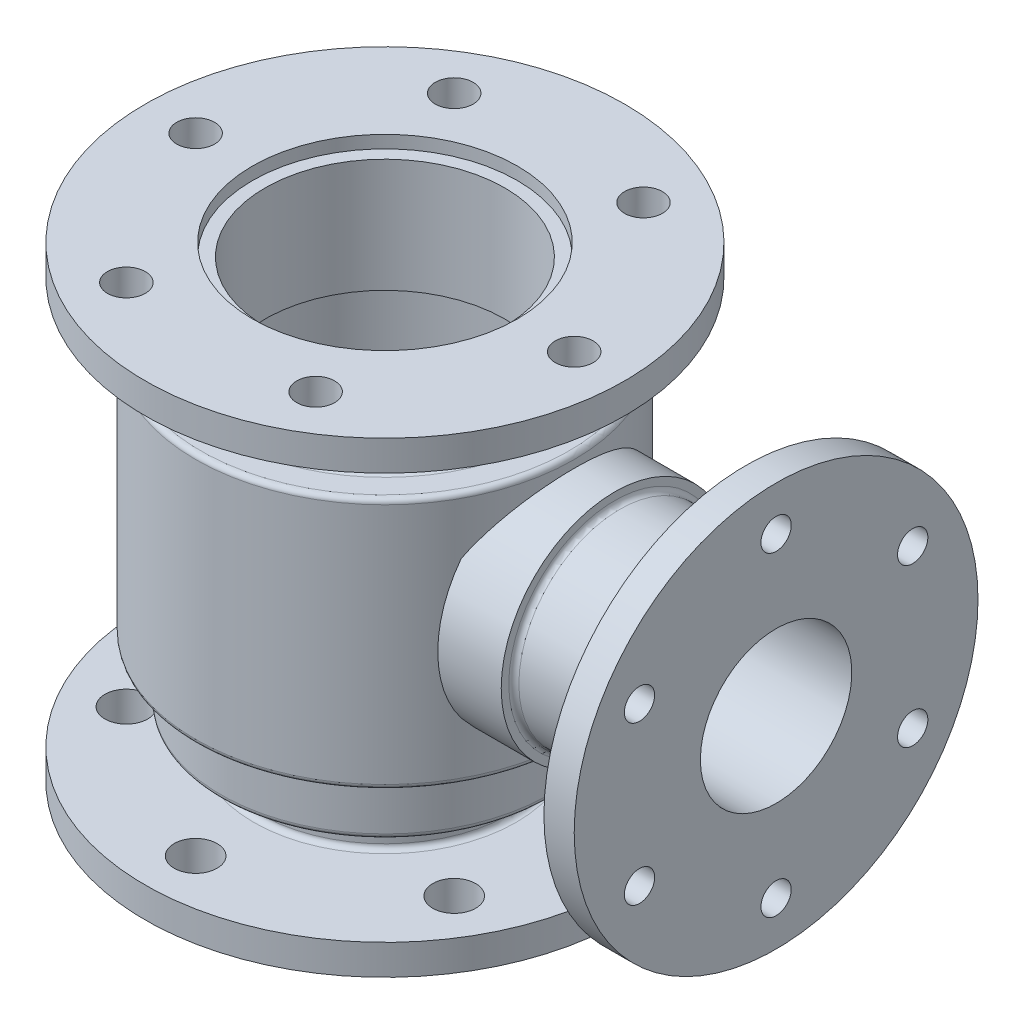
ISO-10303-21;
HEADER;
FILE_DESCRIPTION(('STEP AP214'),'2;1');
FILE_NAME('part.step','',(''),(''),'','','');
FILE_SCHEMA(('AUTOMOTIVE_DESIGN { 1 0 10303 214 1 1 1 1 }'));
ENDSEC;
DATA;
#1=APPLICATION_CONTEXT('core data for automotive mechanical design processes');
#2=APPLICATION_PROTOCOL_DEFINITION('international standard','automotive_design',2000,#1);
#3=PRODUCT_CONTEXT('',#1,'mechanical');
#4=PRODUCT('Part','Part','',(#3));
#5=PRODUCT_RELATED_PRODUCT_CATEGORY('part','',(#4));
#6=PRODUCT_DEFINITION_FORMATION('','',#4);
#7=PRODUCT_DEFINITION_CONTEXT('part definition',#1,'design');
#8=PRODUCT_DEFINITION('design','',#6,#7);
#9=PRODUCT_DEFINITION_SHAPE('','',#8);
#10=(LENGTH_UNIT() NAMED_UNIT(*) SI_UNIT(.MILLI.,.METRE.));
#11=(NAMED_UNIT(*) PLANE_ANGLE_UNIT() SI_UNIT($,.RADIAN.));
#12=(NAMED_UNIT(*) SI_UNIT($,.STERADIAN.) SOLID_ANGLE_UNIT());
#13=UNCERTAINTY_MEASURE_WITH_UNIT(LENGTH_MEASURE(1.E-05),#10,'distance_accuracy_value','');
#14=(GEOMETRIC_REPRESENTATION_CONTEXT(3) GLOBAL_UNCERTAINTY_ASSIGNED_CONTEXT((#13)) GLOBAL_UNIT_ASSIGNED_CONTEXT((#10,
#11,#12)) REPRESENTATION_CONTEXT('',''));
#15=CARTESIAN_POINT('',(0.,0.,0.));
#16=DIRECTION('',(0.,0.,1.));
#17=DIRECTION('',(1.,0.,0.));
#18=AXIS2_PLACEMENT_3D('',#15,#16,#17);
#19=CARTESIAN_POINT('',(0.,0.,0.));
#20=DIRECTION('',(0.,-1.,0.));
#21=DIRECTION('',(0.,0.,-1.));
#22=AXIS2_PLACEMENT_3D('',#19,#20,#21);
#23=CYLINDRICAL_SURFACE('',#22,36.);
#24=CARTESIAN_POINT('',(0.,0.,0.));
#25=DIRECTION('',(0.,-1.,0.));
#26=DIRECTION('',(0.,0.,-1.));
#27=AXIS2_PLACEMENT_3D('',#24,#25,#26);
#28=CIRCLE('',#27,36.);
#29=CARTESIAN_POINT('',(0.,0.,-36.));
#30=VERTEX_POINT('',#29);
#31=EDGE_CURVE('E77',#30,#30,#28,.T.);
#32=ORIENTED_EDGE('',*,*,#31,.T.);
#33=EDGE_LOOP('',(#32));
#34=FACE_BOUND('',#33,.T.);
#35=CARTESIAN_POINT('',(0.,46.,0.));
#36=DIRECTION('',(0.,-1.,0.));
#37=DIRECTION('',(0.,0.,-1.));
#38=AXIS2_PLACEMENT_3D('',#35,#36,#37);
#39=CIRCLE('',#38,36.);
#40=CARTESIAN_POINT('',(0.,46.,-36.));
#41=VERTEX_POINT('',#40);
#42=EDGE_CURVE('E91',#41,#41,#39,.T.);
#43=ORIENTED_EDGE('',*,*,#42,.F.);
#44=EDGE_LOOP('',(#43));
#45=FACE_BOUND('',#44,.T.);
#46=ADVANCED_FACE('F44',(#34,#45),#23,.F.);
#47=CARTESIAN_POINT('',(36.,0.,0.));
#48=DIRECTION('',(0.,-1.,0.));
#49=DIRECTION('',(0.,0.,-1.));
#50=AXIS2_PLACEMENT_3D('',#47,#48,#49);
#51=PLANE('',#50);
#52=CARTESIAN_POINT('',(-64.9519052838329,0.,37.5000000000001));
#53=DIRECTION('',(0.,-1.,0.));
#54=DIRECTION('',(0.,0.,-1.));
#55=AXIS2_PLACEMENT_3D('',#52,#53,#54);
#56=CIRCLE('',#55,8.50000000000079);
#57=CARTESIAN_POINT('',(-64.9519052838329,0.,28.9999999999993));
#58=VERTEX_POINT('',#57);
#59=EDGE_CURVE('E845',#58,#58,#56,.T.);
#60=ORIENTED_EDGE('',*,*,#59,.F.);
#61=EDGE_LOOP('',(#60));
#62=FACE_BOUND('',#61,.T.);
#63=CARTESIAN_POINT('',(-64.9519052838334,0.,-37.5000000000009));
#64=DIRECTION('',(0.,-1.,0.));
#65=DIRECTION('',(0.,0.,-1.));
#66=AXIS2_PLACEMENT_3D('',#63,#64,#65);
#67=CIRCLE('',#66,8.50000000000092);
#68=CARTESIAN_POINT('',(-64.9519052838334,0.,-46.0000000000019));
#69=VERTEX_POINT('',#68);
#70=EDGE_CURVE('E851',#69,#69,#67,.T.);
#71=ORIENTED_EDGE('',*,*,#70,.F.);
#72=EDGE_LOOP('',(#71));
#73=FACE_BOUND('',#72,.T.);
#74=CARTESIAN_POINT('',(0.,0.,-74.9999999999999));
#75=DIRECTION('',(0.,-1.,0.));
#76=DIRECTION('',(0.,0.,-1.));
#77=AXIS2_PLACEMENT_3D('',#74,#75,#76);
#78=CIRCLE('',#77,8.50000000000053);
#79=CARTESIAN_POINT('',(0.,0.,-83.5000000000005));
#80=VERTEX_POINT('',#79);
#81=EDGE_CURVE('E857',#80,#80,#78,.T.);
#82=ORIENTED_EDGE('',*,*,#81,.F.);
#83=EDGE_LOOP('',(#82));
#84=FACE_BOUND('',#83,.T.);
#85=CARTESIAN_POINT('',(64.9519052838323,0.,-37.4999999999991));
#86=DIRECTION('',(0.,-1.,0.));
#87=DIRECTION('',(0.,0.,-1.));
#88=AXIS2_PLACEMENT_3D('',#85,#86,#87);
#89=CIRCLE('',#88,8.50000000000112);
#90=CARTESIAN_POINT('',(64.9519052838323,0.,-46.0000000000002));
#91=VERTEX_POINT('',#90);
#92=EDGE_CURVE('E863',#91,#91,#89,.T.);
#93=ORIENTED_EDGE('',*,*,#92,.F.);
#94=EDGE_LOOP('',(#93));
#95=FACE_BOUND('',#94,.T.);
#96=CARTESIAN_POINT('',(64.9519052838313,0.,37.5000000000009));
#97=DIRECTION('',(0.,-1.,0.));
#98=DIRECTION('',(0.,0.,-1.));
#99=AXIS2_PLACEMENT_3D('',#96,#97,#98);
#100=CIRCLE('',#99,8.50000000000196);
#101=CARTESIAN_POINT('',(64.9519052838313,0.,28.999999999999));
#102=VERTEX_POINT('',#101);
#103=EDGE_CURVE('E869',#102,#102,#100,.T.);
#104=ORIENTED_EDGE('',*,*,#103,.F.);
#105=EDGE_LOOP('',(#104));
#106=FACE_BOUND('',#105,.T.);
#107=CARTESIAN_POINT('',(0.,0.,75.));
#108=DIRECTION('',(0.,-1.,0.));
#109=DIRECTION('',(0.,0.,-1.));
#110=AXIS2_PLACEMENT_3D('',#107,#108,#109);
#111=CIRCLE('',#110,8.5);
#112=CARTESIAN_POINT('',(0.,0.,66.5));
#113=VERTEX_POINT('',#112);
#114=EDGE_CURVE('E875',#113,#113,#111,.T.);
#115=ORIENTED_EDGE('',*,*,#114,.F.);
#116=EDGE_LOOP('',(#115));
#117=FACE_BOUND('',#116,.T.);
#118=CARTESIAN_POINT('',(0.,0.,0.));
#119=DIRECTION('',(0.,-1.,0.));
#120=DIRECTION('',(0.,0.,-1.));
#121=AXIS2_PLACEMENT_3D('',#118,#119,#120);
#122=CIRCLE('',#121,95.);
#123=CARTESIAN_POINT('',(0.,0.,-95.));
#124=VERTEX_POINT('',#123);
#125=EDGE_CURVE('E184',#124,#124,#122,.T.);
#126=ORIENTED_EDGE('',*,*,#125,.T.);
#127=EDGE_LOOP('',(#126));
#128=FACE_BOUND('',#127,.T.);
#129=ORIENTED_EDGE('',*,*,#31,.F.);
#130=EDGE_LOOP('',(#129));
#131=FACE_BOUND('',#130,.T.);
#132=ADVANCED_FACE('F281',(#62,#73,#84,#95,#106,#117,#128,#131),#51,.T.);
#133=CARTESIAN_POINT('',(0.,0.,0.));
#134=DIRECTION('',(0.,-1.,0.));
#135=DIRECTION('',(0.,0.,-1.));
#136=AXIS2_PLACEMENT_3D('',#133,#134,#135);
#137=CYLINDRICAL_SURFACE('',#136,95.);
#138=CARTESIAN_POINT('',(0.,12.,0.));
#139=DIRECTION('',(0.,-1.,0.));
#140=DIRECTION('',(0.,0.,-1.));
#141=AXIS2_PLACEMENT_3D('',#138,#139,#140);
#142=CIRCLE('',#141,95.);
#143=CARTESIAN_POINT('',(0.,12.,-95.));
#144=VERTEX_POINT('',#143);
#145=EDGE_CURVE('E181',#144,#144,#142,.T.);
#146=ORIENTED_EDGE('',*,*,#145,.T.);
#147=EDGE_LOOP('',(#146));
#148=FACE_BOUND('',#147,.T.);
#149=ORIENTED_EDGE('',*,*,#125,.F.);
#150=EDGE_LOOP('',(#149));
#151=FACE_BOUND('',#150,.T.);
#152=ADVANCED_FACE('F286',(#148,#151),#137,.T.);
#153=CARTESIAN_POINT('',(95.,12.,0.));
#154=DIRECTION('',(0.,1.,0.));
#155=DIRECTION('',(0.,0.,1.));
#156=AXIS2_PLACEMENT_3D('',#153,#154,#155);
#157=PLANE('',#156);
#158=CARTESIAN_POINT('',(-64.9519052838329,12.,37.5000000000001));
#159=DIRECTION('',(0.,1.,0.));
#160=DIRECTION('',(0.,0.,1.));
#161=AXIS2_PLACEMENT_3D('',#158,#159,#160);
#162=CIRCLE('',#161,8.50000000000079);
#163=CARTESIAN_POINT('',(-64.9519052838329,12.,46.0000000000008));
#164=VERTEX_POINT('',#163);
#165=EDGE_CURVE('E848',#164,#164,#162,.F.);
#166=ORIENTED_EDGE('',*,*,#165,.T.);
#167=EDGE_LOOP('',(#166));
#168=FACE_BOUND('',#167,.T.);
#169=CARTESIAN_POINT('',(-64.9519052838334,12.,-37.5000000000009));
#170=DIRECTION('',(0.,1.,0.));
#171=DIRECTION('',(0.,0.,1.));
#172=AXIS2_PLACEMENT_3D('',#169,#170,#171);
#173=CIRCLE('',#172,8.50000000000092);
#174=CARTESIAN_POINT('',(-64.9519052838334,12.,-29.));
#175=VERTEX_POINT('',#174);
#176=EDGE_CURVE('E854',#175,#175,#173,.F.);
#177=ORIENTED_EDGE('',*,*,#176,.T.);
#178=EDGE_LOOP('',(#177));
#179=FACE_BOUND('',#178,.T.);
#180=CARTESIAN_POINT('',(0.,12.,-74.9999999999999));
#181=DIRECTION('',(0.,1.,0.));
#182=DIRECTION('',(0.,0.,1.));
#183=AXIS2_PLACEMENT_3D('',#180,#181,#182);
#184=CIRCLE('',#183,8.50000000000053);
#185=CARTESIAN_POINT('',(0.,12.,-66.4999999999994));
#186=VERTEX_POINT('',#185);
#187=EDGE_CURVE('E860',#186,#186,#184,.F.);
#188=ORIENTED_EDGE('',*,*,#187,.T.);
#189=EDGE_LOOP('',(#188));
#190=FACE_BOUND('',#189,.T.);
#191=CARTESIAN_POINT('',(64.9519052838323,12.,-37.4999999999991));
#192=DIRECTION('',(0.,1.,0.));
#193=DIRECTION('',(0.,0.,1.));
#194=AXIS2_PLACEMENT_3D('',#191,#192,#193);
#195=CIRCLE('',#194,8.50000000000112);
#196=CARTESIAN_POINT('',(64.9519052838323,12.,-28.999999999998));
#197=VERTEX_POINT('',#196);
#198=EDGE_CURVE('E866',#197,#197,#195,.F.);
#199=ORIENTED_EDGE('',*,*,#198,.T.);
#200=EDGE_LOOP('',(#199));
#201=FACE_BOUND('',#200,.T.);
#202=CARTESIAN_POINT('',(64.9519052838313,12.,37.5000000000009));
#203=DIRECTION('',(0.,1.,0.));
#204=DIRECTION('',(0.,0.,1.));
#205=AXIS2_PLACEMENT_3D('',#202,#203,#204);
#206=CIRCLE('',#205,8.50000000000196);
#207=CARTESIAN_POINT('',(64.9519052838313,12.,46.0000000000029));
#208=VERTEX_POINT('',#207);
#209=EDGE_CURVE('E872',#208,#208,#206,.F.);
#210=ORIENTED_EDGE('',*,*,#209,.T.);
#211=EDGE_LOOP('',(#210));
#212=FACE_BOUND('',#211,.T.);
#213=CARTESIAN_POINT('',(0.,12.,75.));
#214=DIRECTION('',(0.,1.,0.));
#215=DIRECTION('',(0.,0.,1.));
#216=AXIS2_PLACEMENT_3D('',#213,#214,#215);
#217=CIRCLE('',#216,8.5);
#218=CARTESIAN_POINT('',(0.,12.,83.5));
#219=VERTEX_POINT('',#218);
#220=EDGE_CURVE('E878',#219,#219,#217,.F.);
#221=ORIENTED_EDGE('',*,*,#220,.T.);
#222=EDGE_LOOP('',(#221));
#223=FACE_BOUND('',#222,.T.);
#224=CARTESIAN_POINT('',(0.,12.,0.));
#225=DIRECTION('',(0.,-1.,0.));
#226=DIRECTION('',(0.,0.,-1.));
#227=AXIS2_PLACEMENT_3D('',#224,#225,#226);
#228=CIRCLE('',#227,52.);
#229=CARTESIAN_POINT('',(0.,12.,-52.));
#230=VERTEX_POINT('',#229);
#231=EDGE_CURVE('E178',#230,#230,#228,.T.);
#232=ORIENTED_EDGE('',*,*,#231,.T.);
#233=EDGE_LOOP('',(#232));
#234=FACE_BOUND('',#233,.T.);
#235=ORIENTED_EDGE('',*,*,#145,.F.);
#236=EDGE_LOOP('',(#235));
#237=FACE_BOUND('',#236,.T.);
#238=ADVANCED_FACE('F434',(#168,#179,#190,#201,#212,#223,#234,#237),#157,.T.);
#239=CARTESIAN_POINT('',(0.,14.,0.));
#240=DIRECTION('',(0.,-1.,0.));
#241=DIRECTION('',(0.,0.,-1.));
#242=AXIS2_PLACEMENT_3D('',#239,#240,#241);
#243=TOROIDAL_SURFACE('',#242,52.,2.);
#244=CARTESIAN_POINT('',(0.,14.,0.));
#245=DIRECTION('',(0.,-1.,0.));
#246=DIRECTION('',(0.,0.,-1.));
#247=AXIS2_PLACEMENT_3D('',#244,#245,#246);
#248=CIRCLE('',#247,50.);
#249=CARTESIAN_POINT('',(0.,14.,-50.));
#250=VERTEX_POINT('',#249);
#251=EDGE_CURVE('E175',#250,#250,#248,.T.);
#252=ORIENTED_EDGE('',*,*,#251,.T.);
#253=EDGE_LOOP('',(#252));
#254=FACE_BOUND('',#253,.T.);
#255=ORIENTED_EDGE('',*,*,#231,.F.);
#256=EDGE_LOOP('',(#255));
#257=FACE_BOUND('',#256,.T.);
#258=ADVANCED_FACE('F428',(#254,#257),#243,.F.);
#259=CARTESIAN_POINT('',(0.,0.,0.));
#260=DIRECTION('',(0.,-1.,0.));
#261=DIRECTION('',(0.,0.,-1.));
#262=AXIS2_PLACEMENT_3D('',#259,#260,#261);
#263=CYLINDRICAL_SURFACE('',#262,50.);
#264=CARTESIAN_POINT('',(0.,24.,0.));
#265=DIRECTION('',(0.,-1.,0.));
#266=DIRECTION('',(0.,0.,-1.));
#267=AXIS2_PLACEMENT_3D('',#264,#265,#266);
#268=CIRCLE('',#267,50.);
#269=CARTESIAN_POINT('',(0.,24.,-50.));
#270=VERTEX_POINT('',#269);
#271=EDGE_CURVE('E172',#270,#270,#268,.T.);
#272=ORIENTED_EDGE('',*,*,#271,.T.);
#273=EDGE_LOOP('',(#272));
#274=FACE_BOUND('',#273,.T.);
#275=ORIENTED_EDGE('',*,*,#251,.F.);
#276=EDGE_LOOP('',(#275));
#277=FACE_BOUND('',#276,.T.);
#278=ADVANCED_FACE('F422',(#274,#277),#263,.T.);
#279=CARTESIAN_POINT('',(0.,24.,0.));
#280=DIRECTION('',(0.,-1.,0.));
#281=DIRECTION('',(0.,0.,-1.));
#282=AXIS2_PLACEMENT_3D('',#279,#280,#281);
#283=TOROIDAL_SURFACE('',#282,52.,2.);
#284=CARTESIAN_POINT('',(0.,26.,0.));
#285=DIRECTION('',(0.,-1.,0.));
#286=DIRECTION('',(0.,0.,-1.));
#287=AXIS2_PLACEMENT_3D('',#284,#285,#286);
#288=CIRCLE('',#287,52.);
#289=CARTESIAN_POINT('',(0.,26.,-52.));
#290=VERTEX_POINT('',#289);
#291=EDGE_CURVE('E169',#290,#290,#288,.T.);
#292=ORIENTED_EDGE('',*,*,#291,.T.);
#293=EDGE_LOOP('',(#292));
#294=FACE_BOUND('',#293,.T.);
#295=ORIENTED_EDGE('',*,*,#271,.F.);
#296=EDGE_LOOP('',(#295));
#297=FACE_BOUND('',#296,.T.);
#298=ADVANCED_FACE('F416',(#294,#297),#283,.F.);
#299=CARTESIAN_POINT('',(52.,26.,0.));
#300=DIRECTION('',(0.,-1.,0.));
#301=DIRECTION('',(0.,0.,-1.));
#302=AXIS2_PLACEMENT_3D('',#299,#300,#301);
#303=PLANE('',#302);
#304=CARTESIAN_POINT('',(0.,26.,0.));
#305=DIRECTION('',(0.,-1.,0.));
#306=DIRECTION('',(0.,0.,-1.));
#307=AXIS2_PLACEMENT_3D('',#304,#305,#306);
#308=CIRCLE('',#307,63.);
#309=CARTESIAN_POINT('',(0.,26.,-63.));
#310=VERTEX_POINT('',#309);
#311=EDGE_CURVE('E166',#310,#310,#308,.T.);
#312=ORIENTED_EDGE('',*,*,#311,.T.);
#313=EDGE_LOOP('',(#312));
#314=FACE_BOUND('',#313,.T.);
#315=ORIENTED_EDGE('',*,*,#291,.F.);
#316=EDGE_LOOP('',(#315));
#317=FACE_BOUND('',#316,.T.);
#318=ADVANCED_FACE('F410',(#314,#317),#303,.T.);
#319=CARTESIAN_POINT('',(0.,28.,0.));
#320=DIRECTION('',(0.,-1.,0.));
#321=DIRECTION('',(0.,0.,-1.));
#322=AXIS2_PLACEMENT_3D('',#319,#320,#321);
#323=TOROIDAL_SURFACE('',#322,63.,2.00000000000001);
#324=CARTESIAN_POINT('',(0.,28.,0.));
#325=DIRECTION('',(0.,-1.,0.));
#326=DIRECTION('',(0.,0.,-1.));
#327=AXIS2_PLACEMENT_3D('',#324,#325,#326);
#328=CIRCLE('',#327,65.);
#329=CARTESIAN_POINT('',(0.,28.,-65.));
#330=VERTEX_POINT('',#329);
#331=EDGE_CURVE('E163',#330,#330,#328,.T.);
#332=ORIENTED_EDGE('',*,*,#331,.T.);
#333=EDGE_LOOP('',(#332));
#334=FACE_BOUND('',#333,.T.);
#335=ORIENTED_EDGE('',*,*,#311,.F.);
#336=EDGE_LOOP('',(#335));
#337=FACE_BOUND('',#336,.T.);
#338=ADVANCED_FACE('F404',(#334,#337),#323,.T.);
#339=CARTESIAN_POINT('',(0.,0.,0.));
#340=DIRECTION('',(0.,-1.,0.));
#341=DIRECTION('',(0.,0.,-1.));
#342=AXIS2_PLACEMENT_3D('',#339,#340,#341);
#343=CYLINDRICAL_SURFACE('',#342,65.);
#344=CARTESIAN_POINT('',(0.,48.,0.));
#345=DIRECTION('',(0.,-1.,0.));
#346=DIRECTION('',(0.,0.,-1.));
#347=AXIS2_PLACEMENT_3D('',#344,#345,#346);
#348=CIRCLE('',#347,65.);
#349=CARTESIAN_POINT('',(0.,48.,-65.));
#350=VERTEX_POINT('',#349);
#351=EDGE_CURVE('E160',#350,#350,#348,.T.);
#352=ORIENTED_EDGE('',*,*,#351,.T.);
#353=EDGE_LOOP('',(#352));
#354=FACE_BOUND('',#353,.T.);
#355=ORIENTED_EDGE('',*,*,#331,.F.);
#356=EDGE_LOOP('',(#355));
#357=FACE_BOUND('',#356,.T.);
#358=ADVANCED_FACE('F398',(#354,#357),#343,.T.);
#359=CARTESIAN_POINT('',(0.,48.,0.));
#360=DIRECTION('',(0.,-1.,0.));
#361=DIRECTION('',(0.,0.,-1.));
#362=AXIS2_PLACEMENT_3D('',#359,#360,#361);
#363=TOROIDAL_SURFACE('',#362,67.,2.);
#364=CARTESIAN_POINT('',(0.,50.,0.));
#365=DIRECTION('',(0.,-1.,0.));
#366=DIRECTION('',(0.,0.,-1.));
#367=AXIS2_PLACEMENT_3D('',#364,#365,#366);
#368=CIRCLE('',#367,67.);
#369=CARTESIAN_POINT('',(0.,50.,-67.));
#370=VERTEX_POINT('',#369);
#371=EDGE_CURVE('E157',#370,#370,#368,.T.);
#372=ORIENTED_EDGE('',*,*,#371,.T.);
#373=EDGE_LOOP('',(#372));
#374=FACE_BOUND('',#373,.T.);
#375=ORIENTED_EDGE('',*,*,#351,.F.);
#376=EDGE_LOOP('',(#375));
#377=FACE_BOUND('',#376,.T.);
#378=ADVANCED_FACE('F392',(#374,#377),#363,.F.);
#379=CARTESIAN_POINT('',(67.,50.,0.));
#380=DIRECTION('',(0.,-1.,0.));
#381=DIRECTION('',(0.,0.,-1.));
#382=AXIS2_PLACEMENT_3D('',#379,#380,#381);
#383=PLANE('',#382);
#384=CARTESIAN_POINT('',(0.,50.,0.));
#385=DIRECTION('',(0.,-1.,0.));
#386=DIRECTION('',(0.,0.,-1.));
#387=AXIS2_PLACEMENT_3D('',#384,#385,#386);
#388=CIRCLE('',#387,73.);
#389=CARTESIAN_POINT('',(0.,50.,-73.));
#390=VERTEX_POINT('',#389);
#391=EDGE_CURVE('E154',#390,#390,#388,.T.);
#392=ORIENTED_EDGE('',*,*,#391,.T.);
#393=EDGE_LOOP('',(#392));
#394=FACE_BOUND('',#393,.T.);
#395=ORIENTED_EDGE('',*,*,#371,.F.);
#396=EDGE_LOOP('',(#395));
#397=FACE_BOUND('',#396,.T.);
#398=ADVANCED_FACE('F387',(#394,#397),#383,.T.);
#399=CARTESIAN_POINT('',(0.,52.,0.));
#400=DIRECTION('',(0.,-1.,0.));
#401=DIRECTION('',(0.,0.,-1.));
#402=AXIS2_PLACEMENT_3D('',#399,#400,#401);
#403=TOROIDAL_SURFACE('',#402,73.,1.99999999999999);
#404=CARTESIAN_POINT('',(0.,52.,0.));
#405=DIRECTION('',(0.,-1.,0.));
#406=DIRECTION('',(0.,0.,-1.));
#407=AXIS2_PLACEMENT_3D('',#404,#405,#406);
#408=CIRCLE('',#407,75.);
#409=CARTESIAN_POINT('',(0.,52.,-75.));
#410=VERTEX_POINT('',#409);
#411=EDGE_CURVE('E151',#410,#410,#408,.T.);
#412=ORIENTED_EDGE('',*,*,#411,.T.);
#413=EDGE_LOOP('',(#412));
#414=FACE_BOUND('',#413,.T.);
#415=ORIENTED_EDGE('',*,*,#391,.F.);
#416=EDGE_LOOP('',(#415));
#417=FACE_BOUND('',#416,.T.);
#418=ADVANCED_FACE('F382',(#414,#417),#403,.T.);
#419=CARTESIAN_POINT('',(0.,0.,0.));
#420=DIRECTION('',(0.,-1.,0.));
#421=DIRECTION('',(0.,0.,-1.));
#422=AXIS2_PLACEMENT_3D('',#419,#420,#421);
#423=CYLINDRICAL_SURFACE('',#422,75.);
#424=DIRECTION('',(0.,-1.,0.));
#425=VECTOR('',#424,1.);
#426=CARTESIAN_POINT('',(65.9454264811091,0.,-35.7239517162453));
#427=LINE('',#426,#425);
#428=CARTESIAN_POINT('',(65.9454264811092,72.6358030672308,-35.7239517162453));
#429=VERTEX_POINT('',#428);
#430=CARTESIAN_POINT('',(65.9454264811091,127.364196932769,-35.7239517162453));
#431=VERTEX_POINT('',#430);
#432=EDGE_CURVE('E13',#429,#431,#427,.F.);
#433=ORIENTED_EDGE('',*,*,#432,.F.);
#434=CARTESIAN_POINT('',(60.,100.,45.));
#435=CARTESIAN_POINT('',(60.0000002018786,99.4339592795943,44.9999997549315));
#436=CARTESIAN_POINT('',(60.0080202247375,98.867923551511,44.9893138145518));
#437=CARTESIAN_POINT('',(60.0399947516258,97.737094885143,44.9466306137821));
#438=CARTESIAN_POINT('',(60.063950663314,97.1723020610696,44.9146314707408));
#439=CARTESIAN_POINT('',(60.1593712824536,95.4818681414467,44.7868554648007));
#440=CARTESIAN_POINT('',(60.2543891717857,94.3597314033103,44.6592998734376));
#441=CARTESIAN_POINT('',(60.5033323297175,92.1337033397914,44.3214435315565));
#442=CARTESIAN_POINT('',(60.6573114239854,91.0298296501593,44.1110671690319));
#443=CARTESIAN_POINT('',(60.9277060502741,89.3945728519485,43.7360041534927));
#444=CARTESIAN_POINT('',(61.0244193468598,88.8528637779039,43.6010515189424));
#445=CARTESIAN_POINT('',(61.2301030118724,87.7768936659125,43.3117309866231));
#446=CARTESIAN_POINT('',(61.3390756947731,87.2426340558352,43.1573594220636));
#447=CARTESIAN_POINT('',(61.6812020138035,85.6603561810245,42.6683374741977));
#448=CARTESIAN_POINT('',(61.9309871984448,84.6243915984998,42.305831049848));
#449=CARTESIAN_POINT('',(62.4671927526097,82.5898313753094,41.5099957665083));
#450=CARTESIAN_POINT('',(62.7536179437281,81.5912406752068,41.0766575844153));
#451=CARTESIAN_POINT('',(63.2046901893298,80.1241461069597,40.3762837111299));
#452=CARTESIAN_POINT('',(63.3586502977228,79.6401603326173,40.1343822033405));
#453=CARTESIAN_POINT('',(63.6727102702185,78.6829087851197,39.6342421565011));
#454=CARTESIAN_POINT('',(63.832808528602,78.2096402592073,39.3760078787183));
#455=CARTESIAN_POINT('',(64.3209707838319,76.80609922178,38.5772222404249));
#456=CARTESIAN_POINT('',(64.6568933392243,75.8921199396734,38.012601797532));
#457=CARTESIAN_POINT('',(65.3840831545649,74.0013360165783,36.7493636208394));
#458=CARTESIAN_POINT('',(65.777094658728,73.0305180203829,36.0428031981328));
#459=CARTESIAN_POINT('',(66.5702036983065,71.1500643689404,34.5560113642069));
#460=CARTESIAN_POINT('',(66.9703016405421,70.2404322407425,33.7757757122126));
#461=CARTESIAN_POINT('',(67.7685607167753,68.4850948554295,32.1441679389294));
#462=CARTESIAN_POINT('',(68.1667202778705,67.6394353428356,31.2927458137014));
#463=CARTESIAN_POINT('',(68.9519814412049,66.016474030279,29.5222329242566));
#464=CARTESIAN_POINT('',(69.3390824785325,65.2391757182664,28.6031387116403));
#465=CARTESIAN_POINT('',(70.1346032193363,63.6769738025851,26.5974335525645));
#466=CARTESIAN_POINT('',(70.5407959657,62.9003518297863,25.5034582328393));
#467=CARTESIAN_POINT('',(71.3180723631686,61.4429331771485,23.2414027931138));
#468=CARTESIAN_POINT('',(71.6891528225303,60.7621452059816,22.0733159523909));
#469=CARTESIAN_POINT('',(72.3853204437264,59.5042116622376,19.6704998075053));
#470=CARTESIAN_POINT('',(72.7104396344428,58.9269938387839,18.4358177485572));
#471=CARTESIAN_POINT('',(73.3050628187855,57.8833015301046,15.9076393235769));
#472=CARTESIAN_POINT('',(73.5745759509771,57.4168088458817,14.6141526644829));
#473=CARTESIAN_POINT('',(74.0266149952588,56.6406952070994,12.1048416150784));
#474=CARTESIAN_POINT('',(74.2149871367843,56.3203533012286,10.8933829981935));
#475=CARTESIAN_POINT('',(74.5337841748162,55.7808585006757,8.44060348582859));
#476=CARTESIAN_POINT('',(74.6642124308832,55.5616997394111,7.19928432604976));
#477=CARTESIAN_POINT('',(74.8631695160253,55.2282226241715,4.69870075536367));
#478=CARTESIAN_POINT('',(74.9317468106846,55.1138221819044,3.43945118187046));
#479=CARTESIAN_POINT('',(75.0050652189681,54.9915305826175,0.913984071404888));
#480=CARTESIAN_POINT('',(75.009812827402,54.9836285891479,-0.35223274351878));
#481=CARTESIAN_POINT('',(74.9587550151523,55.0687674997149,-2.7223429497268));
#482=CARTESIAN_POINT('',(74.9103949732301,55.1493966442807,-3.8268700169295));
#483=CARTESIAN_POINT('',(74.7658040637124,55.3913134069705,-6.02378691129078));
#484=CARTESIAN_POINT('',(74.669578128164,55.552592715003,-7.11617797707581));
#485=CARTESIAN_POINT('',(74.4314657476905,55.9537844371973,-9.28134364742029));
#486=CARTESIAN_POINT('',(74.2895776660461,56.19369967,-10.3541175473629));
#487=CARTESIAN_POINT('',(73.9632897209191,56.7493494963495,-12.4732193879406));
#488=CARTESIAN_POINT('',(73.7788881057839,57.0650872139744,-13.5195462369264));
#489=CARTESIAN_POINT('',(73.3703214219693,57.7710127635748,-15.5856109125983));
#490=CARTESIAN_POINT('',(73.1459357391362,58.1616146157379,-16.6051632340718));
#491=CARTESIAN_POINT('',(72.6626847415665,59.0123399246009,-18.6062865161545));
#492=CARTESIAN_POINT('',(72.4038197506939,59.4724627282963,-19.5878578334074));
#493=CARTESIAN_POINT('',(71.8565489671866,60.458479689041,-21.5089305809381));
#494=CARTESIAN_POINT('',(71.5681390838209,60.9843829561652,-22.4484261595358));
#495=CARTESIAN_POINT('',(70.9670792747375,62.0982037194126,-24.2817731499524));
#496=CARTESIAN_POINT('',(70.6544278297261,62.6861251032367,-25.1756216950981));
#497=CARTESIAN_POINT('',(69.9718911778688,63.9942623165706,-27.0187327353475));
#498=CARTESIAN_POINT('',(69.5996305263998,64.7218920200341,-27.9618596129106));
#499=CARTESIAN_POINT('',(68.8395967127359,66.246089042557,-29.7839658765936));
#500=CARTESIAN_POINT('',(68.4518224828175,67.0426611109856,-30.6629408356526));
#501=CARTESIAN_POINT('',(67.6685668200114,68.7019081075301,-32.3548313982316));
#502=CARTESIAN_POINT('',(67.2730761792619,69.5646661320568,-33.1676612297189));
#503=CARTESIAN_POINT('',(66.4835796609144,71.3519776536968,-34.7231114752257));
#504=CARTESIAN_POINT('',(66.0895738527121,72.2765340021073,-35.4657286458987));
#505=CARTESIAN_POINT('',(65.2671035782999,74.2951311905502,-36.9596260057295));
#506=CARTESIAN_POINT('',(64.8399463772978,75.3963892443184,-37.701910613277));
#507=CARTESIAN_POINT('',(64.0125242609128,77.6679186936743,-39.0902817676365));
#508=CARTESIAN_POINT('',(63.6122637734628,78.8382013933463,-39.736352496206));
#509=CARTESIAN_POINT('',(62.853865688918,81.2408529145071,-40.9253986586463));
#510=CARTESIAN_POINT('',(62.4956652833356,82.4731251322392,-41.4685285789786));
#511=CARTESIAN_POINT('',(61.8359550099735,84.9945554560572,-42.4460005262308));
#512=CARTESIAN_POINT('',(61.5344228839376,86.2836909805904,-42.880385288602));
#513=CARTESIAN_POINT('',(61.0686910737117,88.5841684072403,-43.5400383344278));
#514=CARTESIAN_POINT('',(60.8889748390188,89.5852213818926,-43.7904529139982));
#515=CARTESIAN_POINT('',(60.5756469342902,91.6090788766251,-44.2228736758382));
#516=CARTESIAN_POINT('',(60.442027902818,92.6318798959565,-44.4048907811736));
#517=CARTESIAN_POINT('',(60.2256393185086,94.6919253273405,-44.6979379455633));
#518=CARTESIAN_POINT('',(60.1428193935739,95.729154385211,-44.8090383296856));
#519=CARTESIAN_POINT('',(60.030886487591,97.8117756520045,-44.9588869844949));
#520=CARTESIAN_POINT('',(60.0017746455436,98.857168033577,-44.99763372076));
#521=CARTESIAN_POINT('',(59.9983808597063,100.949639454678,-45.0021589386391));
#522=CARTESIAN_POINT('',(60.0241743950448,101.996718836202,-44.9678369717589));
#523=CARTESIAN_POINT('',(60.1297490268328,104.083191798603,-44.8265653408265));
#524=CARTESIAN_POINT('',(60.2095304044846,105.122585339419,-44.7196152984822));
#525=CARTESIAN_POINT('',(60.4201732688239,107.186980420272,-44.4346027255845));
#526=CARTESIAN_POINT('',(60.5510690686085,108.211971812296,-44.2564924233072));
#527=CARTESIAN_POINT('',(60.8593552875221,110.240430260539,-43.8315820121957));
#528=CARTESIAN_POINT('',(61.0367470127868,111.243896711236,-43.5847799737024));
#529=CARTESIAN_POINT('',(61.4320634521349,113.222601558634,-43.0257878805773));
#530=CARTESIAN_POINT('',(61.6499311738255,114.197877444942,-42.7136896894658));
#531=CARTESIAN_POINT('',(62.1201070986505,116.117504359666,-42.026959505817));
#532=CARTESIAN_POINT('',(62.3724149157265,117.061855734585,-41.6523282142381));
#533=CARTESIAN_POINT('',(62.9050933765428,118.916666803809,-40.8434044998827));
#534=CARTESIAN_POINT('',(63.1854704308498,119.827118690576,-40.4090984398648));
#535=CARTESIAN_POINT('',(63.7678847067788,121.611442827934,-39.4836147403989));
#536=CARTESIAN_POINT('',(64.0699236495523,122.485312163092,-38.9924325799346));
#537=CARTESIAN_POINT('',(64.7454118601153,124.348557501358,-37.8621127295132));
#538=CARTESIAN_POINT('',(65.1219165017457,125.330345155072,-37.2122669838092));
#539=CARTESIAN_POINT('',(65.8869803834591,127.237050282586,-35.8402410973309));
#540=CARTESIAN_POINT('',(66.2755407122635,128.161962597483,-35.1180544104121));
#541=CARTESIAN_POINT('',(67.0560491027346,129.952689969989,-33.6037555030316));
#542=CARTESIAN_POINT('',(67.4479998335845,130.818452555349,-32.8115825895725));
#543=CARTESIAN_POINT('',(68.2264192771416,132.486744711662,-31.1606926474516));
#544=CARTESIAN_POINT('',(68.6128877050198,133.289271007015,-30.3019721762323));
#545=CARTESIAN_POINT('',(69.4216767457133,134.927652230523,-28.4047121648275));
#546=CARTESIAN_POINT('',(69.8421104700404,135.75423283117,-27.3573195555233));
#547=CARTESIAN_POINT('',(70.6542555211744,137.315794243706,-25.1857213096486));
#548=CARTESIAN_POINT('',(71.0459639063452,138.050765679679,-24.0615078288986));
#549=CARTESIAN_POINT('',(71.7896667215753,139.421922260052,-21.7422324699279));
#550=CARTESIAN_POINT('',(72.141680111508,140.058154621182,-20.5472048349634));
#551=CARTESIAN_POINT('',(72.6322302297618,140.932857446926,-18.7072966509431));
#552=CARTESIAN_POINT('',(72.7895180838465,141.211178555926,-18.0860243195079));
#553=CARTESIAN_POINT('',(73.0904399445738,141.740386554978,-16.8286981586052));
#554=CARTESIAN_POINT('',(73.2340759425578,141.991277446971,-16.1926465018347));
#555=CARTESIAN_POINT('',(73.4966777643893,142.447542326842,-14.9535919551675));
#556=CARTESIAN_POINT('',(73.6166771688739,142.654897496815,-14.3515359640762));
#557=CARTESIAN_POINT('',(73.8430970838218,143.044490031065,-13.1369157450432));
#558=CARTESIAN_POINT('',(73.9495194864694,143.226730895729,-12.5243529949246));
#559=CARTESIAN_POINT('',(74.1480399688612,143.565475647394,-11.2897790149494));
#560=CARTESIAN_POINT('',(74.2401364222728,143.721976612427,-10.6677667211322));
#561=CARTESIAN_POINT('',(74.4092917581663,144.008591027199,-9.41574645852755));
#562=CARTESIAN_POINT('',(74.4863525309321,144.138707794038,-8.78573950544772));
#563=CARTESIAN_POINT('',(74.6248040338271,144.3719526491,-7.51956601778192));
#564=CARTESIAN_POINT('',(74.686207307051,144.475102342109,-6.88340484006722));
#565=CARTESIAN_POINT('',(74.7929379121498,144.654100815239,-5.60599644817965));
#566=CARTESIAN_POINT('',(74.8382673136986,144.729953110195,-4.96474989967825));
#567=CARTESIAN_POINT('',(74.9124974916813,144.854038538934,-3.67865453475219));
#568=CARTESIAN_POINT('',(74.9413989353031,144.902272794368,-3.03380586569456));
#569=CARTESIAN_POINT('',(74.9825487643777,144.970916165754,-1.74216588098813));
#570=CARTESIAN_POINT('',(74.9947977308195,144.991326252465,-1.09537463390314));
#571=CARTESIAN_POINT('',(75.0053518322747,145.008925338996,0.67275511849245));
#572=CARTESIAN_POINT('',(74.9868699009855,144.978152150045,1.79464550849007));
#573=CARTESIAN_POINT('',(74.8999684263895,144.833118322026,4.03078976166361));
#574=CARTESIAN_POINT('',(74.8315542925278,144.718866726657,5.14504443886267));
#575=CARTESIAN_POINT('',(74.6464500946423,144.40842311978,7.35800337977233));
#576=CARTESIAN_POINT('',(74.5297603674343,144.212231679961,8.45670775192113));
#577=CARTESIAN_POINT('',(74.2508159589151,143.740368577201,10.6309874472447));
#578=CARTESIAN_POINT('',(74.088559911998,143.46469453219,11.7065620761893));
#579=CARTESIAN_POINT('',(73.7250709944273,142.842138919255,13.8107029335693));
#580=CARTESIAN_POINT('',(73.5245090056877,142.496477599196,14.8397475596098));
#581=CARTESIAN_POINT('',(73.086923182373,141.734823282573,16.863374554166));
#582=CARTESIAN_POINT('',(72.8499002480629,141.318832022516,17.857957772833));
#583=CARTESIAN_POINT('',(72.3439768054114,140.420154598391,19.8081817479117));
#584=CARTESIAN_POINT('',(72.0750728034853,139.937461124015,20.7638182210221));
#585=CARTESIAN_POINT('',(71.5103683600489,138.909091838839,22.6322770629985));
#586=CARTESIAN_POINT('',(71.2145662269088,138.363412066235,23.5450967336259));
#587=CARTESIAN_POINT('',(70.5679780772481,137.150114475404,25.4214279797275));
#588=CARTESIAN_POINT('',(70.2147090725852,136.475690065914,26.3796855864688));
#589=CARTESIAN_POINT('',(69.4889040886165,135.058214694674,28.2362504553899));
#590=CARTESIAN_POINT('',(69.1163669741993,134.315159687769,29.1345541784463));
#591=CARTESIAN_POINT('',(68.3593207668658,132.763635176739,30.8690730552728));
#592=CARTESIAN_POINT('',(67.9747999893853,131.955100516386,31.7052247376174));
#593=CARTESIAN_POINT('',(67.2020614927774,130.276594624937,33.3118201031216));
#594=CARTESIAN_POINT('',(66.8138435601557,129.406619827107,34.0822599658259));
#595=CARTESIAN_POINT('',(66.2106334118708,128.001021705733,35.2331039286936));
#596=CARTESIAN_POINT('',(65.9939756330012,127.485159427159,35.6370000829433));
#597=CARTESIAN_POINT('',(65.563749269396,126.435476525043,36.4224546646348));
#598=CARTESIAN_POINT('',(65.3501804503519,125.901657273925,36.804014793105));
#599=CARTESIAN_POINT('',(64.9277451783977,124.816563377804,37.5442339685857));
#600=CARTESIAN_POINT('',(64.718878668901,124.265288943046,37.9028932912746));
#601=CARTESIAN_POINT('',(64.3074625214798,123.145645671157,38.5968013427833));
#602=CARTESIAN_POINT('',(64.1049152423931,122.577270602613,38.9320413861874));
#603=CARTESIAN_POINT('',(63.5096363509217,120.848140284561,39.9011329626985));
#604=CARTESIAN_POINT('',(63.1289721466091,119.662631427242,40.4988673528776));
#605=CARTESIAN_POINT('',(62.4145788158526,117.231584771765,41.5914293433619));
#606=CARTESIAN_POINT('',(62.0808376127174,115.986062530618,42.0862834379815));
#607=CARTESIAN_POINT('',(61.6394088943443,114.132816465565,42.727541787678));
#608=CARTESIAN_POINT('',(61.5072995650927,113.545600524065,42.9173550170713));
#609=CARTESIAN_POINT('',(61.2573550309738,112.361163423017,43.2733613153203));
#610=CARTESIAN_POINT('',(61.139516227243,111.763944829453,43.4395603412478));
#611=CARTESIAN_POINT('',(60.9193939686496,110.560426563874,43.7477233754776));
#612=CARTESIAN_POINT('',(60.8171112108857,109.954126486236,43.8896862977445));
#613=CARTESIAN_POINT('',(60.6293037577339,108.733615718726,44.1487615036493));
#614=CARTESIAN_POINT('',(60.5437800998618,108.119404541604,44.2658722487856));
#615=CARTESIAN_POINT('',(60.3907086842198,106.885613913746,44.4744760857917));
#616=CARTESIAN_POINT('',(60.3231276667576,106.266046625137,44.5660165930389));
#617=CARTESIAN_POINT('',(60.2066106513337,105.021903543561,44.7233006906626));
#618=CARTESIAN_POINT('',(60.1576743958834,104.397327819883,44.789044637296));
#619=CARTESIAN_POINT('',(60.0791085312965,103.144818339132,44.8943765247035));
#620=CARTESIAN_POINT('',(60.0494771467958,102.516884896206,44.9339668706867));
#621=CARTESIAN_POINT('',(60.0099230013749,101.259298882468,44.986778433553));
#622=CARTESIAN_POINT('',(59.9999997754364,100.62964635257,45.0000002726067));
#623=CARTESIAN_POINT('',(60.,100.,45.));
#624=B_SPLINE_CURVE_WITH_KNOTS('',3,(#434,#435,#436,#437,#438,#439,#440,#441,#442,#443,#444,
#445,#446,#447,#448,#449,#450,#451,#452,#453,#454,#455,#456,#457,#458,#459,#460,#461,#462,#463,
#464,#465,#466,#467,#468,#469,#470,#471,#472,#473,#474,#475,#476,#477,#478,#479,#480,#481,#482,
#483,#484,#485,#486,#487,#488,#489,#490,#491,#492,#493,#494,#495,#496,#497,#498,#499,#500,#501,
#502,#503,#504,#505,#506,#507,#508,#509,#510,#511,#512,#513,#514,#515,#516,#517,#518,#519,#520,
#521,#522,#523,#524,#525,#526,#527,#528,#529,#530,#531,#532,#533,#534,#535,#536,#537,#538,#539,
#540,#541,#542,#543,#544,#545,#546,#547,#548,#549,#550,#551,#552,#553,#554,#555,#556,#557,#558,
#559,#560,#561,#562,#563,#564,#565,#566,#567,#568,#569,#570,#571,#572,#573,#574,#575,#576,#577,
#578,#579,#580,#581,#582,#583,#584,#585,#586,#587,#588,#589,#590,#591,#592,#593,#594,#595,#596,
#597,#598,#599,#600,#601,#602,#603,#604,#605,#606,#607,#608,#609,#610,#611,#612,#613,#614,#615,
#616,#617,#618,#619,#620,#621,#622,#623),.UNSPECIFIED.,.T.,.F.,(4,2,2,2,2,2,2,2,2,2,2,2,2,2,2,2,
2,2,2,2,2,2,2,2,2,2,2,2,2,2,2,2,2,2,2,2,2,2,2,2,2,2,2,2,2,2,2,2,2,2,2,2,2,2,2,2,2,2,2,2,2,2,2,2,
2,2,2,2,2,2,2,2,2,2,2,2,2,2,2,2,2,2,2,2,2,2,2,2,2,2,2,2,2,2,4),(0.,1.69793763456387,
3.39602527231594,6.79088523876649,10.1888517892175,11.8881490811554,13.5877677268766,
16.9607340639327,20.3341447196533,22.0214707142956,23.7083582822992,27.0822322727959,
30.8687212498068,34.6554283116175,38.4448180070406,42.2344009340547,46.4341230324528,
50.6342265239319,54.8313885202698,59.0278601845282,62.82392581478,66.6197713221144,
70.4126398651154,74.205122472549,77.5267111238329,80.8479575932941,84.1693231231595,
87.4908255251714,90.8312564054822,94.171655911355,97.5125185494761,100.853590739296,
104.593777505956,108.334222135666,112.079442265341,115.824835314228,120.00487326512,
124.185597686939,128.359997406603,132.532754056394,135.671882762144,138.810509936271,
141.946019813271,145.081596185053,148.221485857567,151.361391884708,154.503409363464,
157.645515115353,160.783229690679,163.920909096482,167.059306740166,170.197954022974,
173.902599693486,177.607580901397,181.315807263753,185.024225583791,189.215675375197,
193.407553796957,197.597421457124,199.692843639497,201.78795970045,203.731190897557,
205.674150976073,207.617331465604,209.560267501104,211.501642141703,213.442766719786,
215.383812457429,217.324790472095,220.687592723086,224.050030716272,227.412445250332,
230.774960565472,234.08324075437,237.391439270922,240.700000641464,244.00877023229,
247.676723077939,251.344892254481,255.016757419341,258.68883591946,260.758508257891,
262.828022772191,264.897512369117,266.9677654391,271.10542093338,275.242009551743,
277.13479716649,279.027106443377,280.919500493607,282.81201166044,284.700989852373,
286.589941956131,288.478720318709,290.367454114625),.UNSPECIFIED.);
#625=CARTESIAN_POINT('',(65.9454264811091,72.6358030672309,35.7239517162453));
#626=VERTEX_POINT('',#625);
#627=EDGE_CURVE('E51',#626,#429,#624,.T.);
#628=ORIENTED_EDGE('',*,*,#627,.F.);
#629=DIRECTION('',(0.,-1.,0.));
#630=VECTOR('',#629,1.);
#631=CARTESIAN_POINT('',(65.9454264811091,0.,35.7239517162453));
#632=LINE('',#631,#630);
#633=CARTESIAN_POINT('',(65.9454264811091,127.364196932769,35.7239517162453));
#634=VERTEX_POINT('',#633);
#635=EDGE_CURVE('E68',#634,#626,#632,.T.);
#636=ORIENTED_EDGE('',*,*,#635,.F.);
#637=EDGE_CURVE('E61',#431,#634,#624,.T.);
#638=ORIENTED_EDGE('',*,*,#637,.F.);
#639=EDGE_LOOP('',(#433,#628,#636,#638));
#640=FACE_BOUND('',#639,.T.);
#641=CARTESIAN_POINT('',(0.,148.,0.));
#642=DIRECTION('',(0.,-1.,0.));
#643=DIRECTION('',(0.,0.,-1.));
#644=AXIS2_PLACEMENT_3D('',#641,#642,#643);
#645=CIRCLE('',#644,75.);
#646=CARTESIAN_POINT('',(0.,148.,-75.));
#647=VERTEX_POINT('',#646);
#648=EDGE_CURVE('E148',#647,#647,#645,.T.);
#649=ORIENTED_EDGE('',*,*,#648,.T.);
#650=EDGE_LOOP('',(#649));
#651=FACE_BOUND('',#650,.T.);
#652=ORIENTED_EDGE('',*,*,#411,.F.);
#653=EDGE_LOOP('',(#652));
#654=FACE_BOUND('',#653,.T.);
#655=ADVANCED_FACE('F66',(#640,#651,#654),#423,.T.);
#656=CARTESIAN_POINT('',(0.,148.,0.));
#657=DIRECTION('',(0.,-1.,0.));
#658=DIRECTION('',(0.,0.,-1.));
#659=AXIS2_PLACEMENT_3D('',#656,#657,#658);
#660=TOROIDAL_SURFACE('',#659,73.,2.00000000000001);
#661=CARTESIAN_POINT('',(0.,150.,0.));
#662=DIRECTION('',(0.,-1.,0.));
#663=DIRECTION('',(0.,0.,-1.));
#664=AXIS2_PLACEMENT_3D('',#661,#662,#663);
#665=CIRCLE('',#664,73.);
#666=CARTESIAN_POINT('',(0.,150.,-73.));
#667=VERTEX_POINT('',#666);
#668=EDGE_CURVE('E145',#667,#667,#665,.T.);
#669=ORIENTED_EDGE('',*,*,#668,.T.);
#670=EDGE_LOOP('',(#669));
#671=FACE_BOUND('',#670,.T.);
#672=ORIENTED_EDGE('',*,*,#648,.F.);
#673=EDGE_LOOP('',(#672));
#674=FACE_BOUND('',#673,.T.);
#675=ADVANCED_FACE('F373',(#671,#674),#660,.T.);
#676=CARTESIAN_POINT('',(73.,150.,0.));
#677=DIRECTION('',(0.,1.,0.));
#678=DIRECTION('',(0.,0.,1.));
#679=AXIS2_PLACEMENT_3D('',#676,#677,#678);
#680=PLANE('',#679);
#681=CARTESIAN_POINT('',(0.,150.,0.));
#682=DIRECTION('',(0.,-1.,0.));
#683=DIRECTION('',(0.,0.,-1.));
#684=AXIS2_PLACEMENT_3D('',#681,#682,#683);
#685=CIRCLE('',#684,64.5);
#686=CARTESIAN_POINT('',(0.,150.,-64.5));
#687=VERTEX_POINT('',#686);
#688=EDGE_CURVE('E142',#687,#687,#685,.T.);
#689=ORIENTED_EDGE('',*,*,#688,.T.);
#690=EDGE_LOOP('',(#689));
#691=FACE_BOUND('',#690,.T.);
#692=ORIENTED_EDGE('',*,*,#668,.F.);
#693=EDGE_LOOP('',(#692));
#694=FACE_BOUND('',#693,.T.);
#695=ADVANCED_FACE('F367',(#691,#694),#680,.T.);
#696=CARTESIAN_POINT('',(0.,152.,0.));
#697=DIRECTION('',(0.,-1.,0.));
#698=DIRECTION('',(0.,0.,-1.));
#699=AXIS2_PLACEMENT_3D('',#696,#697,#698);
#700=TOROIDAL_SURFACE('',#699,64.5,1.99999999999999);
#701=CARTESIAN_POINT('',(0.,152.,0.));
#702=DIRECTION('',(0.,-1.,0.));
#703=DIRECTION('',(0.,0.,-1.));
#704=AXIS2_PLACEMENT_3D('',#701,#702,#703);
#705=CIRCLE('',#704,62.5);
#706=CARTESIAN_POINT('',(0.,152.,-62.5));
#707=VERTEX_POINT('',#706);
#708=EDGE_CURVE('E139',#707,#707,#705,.T.);
#709=ORIENTED_EDGE('',*,*,#708,.T.);
#710=EDGE_LOOP('',(#709));
#711=FACE_BOUND('',#710,.T.);
#712=ORIENTED_EDGE('',*,*,#688,.F.);
#713=EDGE_LOOP('',(#712));
#714=FACE_BOUND('',#713,.T.);
#715=ADVANCED_FACE('F361',(#711,#714),#700,.F.);
#716=CARTESIAN_POINT('',(0.,0.,0.));
#717=DIRECTION('',(0.,-1.,0.));
#718=DIRECTION('',(0.,0.,-1.));
#719=AXIS2_PLACEMENT_3D('',#716,#717,#718);
#720=CYLINDRICAL_SURFACE('',#719,62.5);
#721=CARTESIAN_POINT('',(0.,171.,0.));
#722=DIRECTION('',(0.,-1.,0.));
#723=DIRECTION('',(0.,0.,-1.));
#724=AXIS2_PLACEMENT_3D('',#721,#722,#723);
#725=CIRCLE('',#724,62.5);
#726=CARTESIAN_POINT('',(0.,171.,-62.5));
#727=VERTEX_POINT('',#726);
#728=EDGE_CURVE('E136',#727,#727,#725,.T.);
#729=ORIENTED_EDGE('',*,*,#728,.T.);
#730=EDGE_LOOP('',(#729));
#731=FACE_BOUND('',#730,.T.);
#732=ORIENTED_EDGE('',*,*,#708,.F.);
#733=EDGE_LOOP('',(#732));
#734=FACE_BOUND('',#733,.T.);
#735=ADVANCED_FACE('F355',(#731,#734),#720,.T.);
#736=CARTESIAN_POINT('',(0.,171.,0.));
#737=DIRECTION('',(0.,-1.,0.));
#738=DIRECTION('',(0.,0.,-1.));
#739=AXIS2_PLACEMENT_3D('',#736,#737,#738);
#740=TOROIDAL_SURFACE('',#739,64.5,2.);
#741=CARTESIAN_POINT('',(0.,173.,0.));
#742=DIRECTION('',(0.,-1.,0.));
#743=DIRECTION('',(0.,0.,-1.));
#744=AXIS2_PLACEMENT_3D('',#741,#742,#743);
#745=CIRCLE('',#744,64.5);
#746=CARTESIAN_POINT('',(0.,173.,-64.5));
#747=VERTEX_POINT('',#746);
#748=EDGE_CURVE('E133',#747,#747,#745,.T.);
#749=ORIENTED_EDGE('',*,*,#748,.T.);
#750=EDGE_LOOP('',(#749));
#751=FACE_BOUND('',#750,.T.);
#752=ORIENTED_EDGE('',*,*,#728,.F.);
#753=EDGE_LOOP('',(#752));
#754=FACE_BOUND('',#753,.T.);
#755=ADVANCED_FACE('F348',(#751,#754),#740,.F.);
#756=CARTESIAN_POINT('',(64.5,173.,0.));
#757=DIRECTION('',(0.,-1.,0.));
#758=DIRECTION('',(0.,0.,-1.));
#759=AXIS2_PLACEMENT_3D('',#756,#757,#758);
#760=PLANE('',#759);
#761=CARTESIAN_POINT('',(37.5,173.,-64.9519052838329));
#762=DIRECTION('',(0.,-1.,0.));
#763=DIRECTION('',(0.,0.,-1.));
#764=AXIS2_PLACEMENT_3D('',#761,#762,#763);
#765=CIRCLE('',#764,7.50000000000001);
#766=CARTESIAN_POINT('',(37.5,173.,-72.4519052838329));
#767=VERTEX_POINT('',#766);
#768=EDGE_CURVE('E884',#767,#767,#765,.F.);
#769=ORIENTED_EDGE('',*,*,#768,.T.);
#770=EDGE_LOOP('',(#769));
#771=FACE_BOUND('',#770,.T.);
#772=CARTESIAN_POINT('',(-37.5,173.,-64.9519052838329));
#773=DIRECTION('',(0.,-1.,0.));
#774=DIRECTION('',(0.,0.,-1.));
#775=AXIS2_PLACEMENT_3D('',#772,#773,#774);
#776=CIRCLE('',#775,7.50000000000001);
#777=CARTESIAN_POINT('',(-37.5,173.,-72.4519052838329));
#778=VERTEX_POINT('',#777);
#779=EDGE_CURVE('E890',#778,#778,#776,.F.);
#780=ORIENTED_EDGE('',*,*,#779,.T.);
#781=EDGE_LOOP('',(#780));
#782=FACE_BOUND('',#781,.T.);
#783=CARTESIAN_POINT('',(-75.,173.,0.));
#784=DIRECTION('',(0.,-1.,0.));
#785=DIRECTION('',(0.,0.,-1.));
#786=AXIS2_PLACEMENT_3D('',#783,#784,#785);
#787=CIRCLE('',#786,7.5);
#788=CARTESIAN_POINT('',(-75.,173.,-7.49999999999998));
#789=VERTEX_POINT('',#788);
#790=EDGE_CURVE('E896',#789,#789,#787,.F.);
#791=ORIENTED_EDGE('',*,*,#790,.T.);
#792=EDGE_LOOP('',(#791));
#793=FACE_BOUND('',#792,.T.);
#794=CARTESIAN_POINT('',(-37.5,173.,64.9519052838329));
#795=DIRECTION('',(0.,-1.,0.));
#796=DIRECTION('',(0.,0.,-1.));
#797=AXIS2_PLACEMENT_3D('',#794,#795,#796);
#798=CIRCLE('',#797,7.50000000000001);
#799=CARTESIAN_POINT('',(-37.5,173.,57.4519052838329));
#800=VERTEX_POINT('',#799);
#801=EDGE_CURVE('E902',#800,#800,#798,.F.);
#802=ORIENTED_EDGE('',*,*,#801,.T.);
#803=EDGE_LOOP('',(#802));
#804=FACE_BOUND('',#803,.T.);
#805=CARTESIAN_POINT('',(37.5,173.,64.9519052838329));
#806=DIRECTION('',(0.,-1.,0.));
#807=DIRECTION('',(0.,0.,-1.));
#808=AXIS2_PLACEMENT_3D('',#805,#806,#807);
#809=CIRCLE('',#808,7.50000000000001);
#810=CARTESIAN_POINT('',(37.5,173.,57.4519052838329));
#811=VERTEX_POINT('',#810);
#812=EDGE_CURVE('E908',#811,#811,#809,.F.);
#813=ORIENTED_EDGE('',*,*,#812,.T.);
#814=EDGE_LOOP('',(#813));
#815=FACE_BOUND('',#814,.T.);
#816=CARTESIAN_POINT('',(75.,173.,0.));
#817=DIRECTION('',(0.,-1.,0.));
#818=DIRECTION('',(0.,0.,-1.));
#819=AXIS2_PLACEMENT_3D('',#816,#817,#818);
#820=CIRCLE('',#819,7.5);
#821=CARTESIAN_POINT('',(75.,173.,-7.5));
#822=VERTEX_POINT('',#821);
#823=EDGE_CURVE('E913',#822,#822,#820,.F.);
#824=ORIENTED_EDGE('',*,*,#823,.T.);
#825=EDGE_LOOP('',(#824));
#826=FACE_BOUND('',#825,.T.);
#827=CARTESIAN_POINT('',(0.,173.,0.));
#828=DIRECTION('',(0.,-1.,0.));
#829=DIRECTION('',(0.,0.,-1.));
#830=AXIS2_PLACEMENT_3D('',#827,#828,#829);
#831=CIRCLE('',#830,95.);
#832=CARTESIAN_POINT('',(0.,173.,-95.));
#833=VERTEX_POINT('',#832);
#834=EDGE_CURVE('E130',#833,#833,#831,.T.);
#835=ORIENTED_EDGE('',*,*,#834,.T.);
#836=EDGE_LOOP('',(#835));
#837=FACE_BOUND('',#836,.T.);
#838=ORIENTED_EDGE('',*,*,#748,.F.);
#839=EDGE_LOOP('',(#838));
#840=FACE_BOUND('',#839,.T.);
#841=ADVANCED_FACE('F342',(#771,#782,#793,#804,#815,#826,#837,#840),#760,.T.);
#842=CARTESIAN_POINT('',(0.,0.,0.));
#843=DIRECTION('',(0.,-1.,0.));
#844=DIRECTION('',(0.,0.,-1.));
#845=AXIS2_PLACEMENT_3D('',#842,#843,#844);
#846=CYLINDRICAL_SURFACE('',#845,95.);
#847=CARTESIAN_POINT('',(0.,185.,0.));
#848=DIRECTION('',(0.,-1.,0.));
#849=DIRECTION('',(0.,0.,-1.));
#850=AXIS2_PLACEMENT_3D('',#847,#848,#849);
#851=CIRCLE('',#850,95.);
#852=CARTESIAN_POINT('',(0.,185.,-95.));
#853=VERTEX_POINT('',#852);
#854=EDGE_CURVE('E127',#853,#853,#851,.T.);
#855=ORIENTED_EDGE('',*,*,#854,.T.);
#856=EDGE_LOOP('',(#855));
#857=FACE_BOUND('',#856,.T.);
#858=ORIENTED_EDGE('',*,*,#834,.F.);
#859=EDGE_LOOP('',(#858));
#860=FACE_BOUND('',#859,.T.);
#861=ADVANCED_FACE('F335',(#857,#860),#846,.T.);
#862=CARTESIAN_POINT('',(95.,185.,0.));
#863=DIRECTION('',(0.,1.,0.));
#864=DIRECTION('',(0.,0.,1.));
#865=AXIS2_PLACEMENT_3D('',#862,#863,#864);
#866=PLANE('',#865);
#867=CARTESIAN_POINT('',(37.5,185.,-64.9519052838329));
#868=DIRECTION('',(0.,1.,0.));
#869=DIRECTION('',(0.,0.,1.));
#870=AXIS2_PLACEMENT_3D('',#867,#868,#869);
#871=CIRCLE('',#870,7.50000000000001);
#872=CARTESIAN_POINT('',(37.5,185.,-57.4519052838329));
#873=VERTEX_POINT('',#872);
#874=EDGE_CURVE('E881',#873,#873,#871,.T.);
#875=ORIENTED_EDGE('',*,*,#874,.F.);
#876=EDGE_LOOP('',(#875));
#877=FACE_BOUND('',#876,.T.);
#878=CARTESIAN_POINT('',(-37.5,185.,-64.9519052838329));
#879=DIRECTION('',(0.,1.,0.));
#880=DIRECTION('',(0.,0.,1.));
#881=AXIS2_PLACEMENT_3D('',#878,#879,#880);
#882=CIRCLE('',#881,7.50000000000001);
#883=CARTESIAN_POINT('',(-37.5,185.,-57.4519052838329));
#884=VERTEX_POINT('',#883);
#885=EDGE_CURVE('E887',#884,#884,#882,.T.);
#886=ORIENTED_EDGE('',*,*,#885,.F.);
#887=EDGE_LOOP('',(#886));
#888=FACE_BOUND('',#887,.T.);
#889=CARTESIAN_POINT('',(-75.,185.,0.));
#890=DIRECTION('',(0.,1.,0.));
#891=DIRECTION('',(0.,0.,1.));
#892=AXIS2_PLACEMENT_3D('',#889,#890,#891);
#893=CIRCLE('',#892,7.5);
#894=CARTESIAN_POINT('',(-75.,185.,7.50000000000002));
#895=VERTEX_POINT('',#894);
#896=EDGE_CURVE('E893',#895,#895,#893,.T.);
#897=ORIENTED_EDGE('',*,*,#896,.F.);
#898=EDGE_LOOP('',(#897));
#899=FACE_BOUND('',#898,.T.);
#900=CARTESIAN_POINT('',(-37.5,185.,64.9519052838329));
#901=DIRECTION('',(0.,1.,0.));
#902=DIRECTION('',(0.,0.,1.));
#903=AXIS2_PLACEMENT_3D('',#900,#901,#902);
#904=CIRCLE('',#903,7.50000000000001);
#905=CARTESIAN_POINT('',(-37.5,185.,72.4519052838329));
#906=VERTEX_POINT('',#905);
#907=EDGE_CURVE('E899',#906,#906,#904,.T.);
#908=ORIENTED_EDGE('',*,*,#907,.F.);
#909=EDGE_LOOP('',(#908));
#910=FACE_BOUND('',#909,.T.);
#911=CARTESIAN_POINT('',(37.5,185.,64.9519052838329));
#912=DIRECTION('',(0.,1.,0.));
#913=DIRECTION('',(0.,0.,1.));
#914=AXIS2_PLACEMENT_3D('',#911,#912,#913);
#915=CIRCLE('',#914,7.50000000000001);
#916=CARTESIAN_POINT('',(37.5,185.,72.4519052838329));
#917=VERTEX_POINT('',#916);
#918=EDGE_CURVE('E905',#917,#917,#915,.T.);
#919=ORIENTED_EDGE('',*,*,#918,.F.);
#920=EDGE_LOOP('',(#919));
#921=FACE_BOUND('',#920,.T.);
#922=CARTESIAN_POINT('',(75.,185.,0.));
#923=DIRECTION('',(0.,1.,0.));
#924=DIRECTION('',(0.,0.,1.));
#925=AXIS2_PLACEMENT_3D('',#922,#923,#924);
#926=CIRCLE('',#925,7.5);
#927=CARTESIAN_POINT('',(75.,185.,7.5));
#928=VERTEX_POINT('',#927);
#929=EDGE_CURVE('E911',#928,#928,#926,.T.);
#930=ORIENTED_EDGE('',*,*,#929,.F.);
#931=EDGE_LOOP('',(#930));
#932=FACE_BOUND('',#931,.T.);
#933=CARTESIAN_POINT('',(0.,185.,0.));
#934=DIRECTION('',(0.,-1.,0.));
#935=DIRECTION('',(0.,0.,-1.));
#936=AXIS2_PLACEMENT_3D('',#933,#934,#935);
#937=CIRCLE('',#936,52.5);
#938=CARTESIAN_POINT('',(0.,185.,-52.5));
#939=VERTEX_POINT('',#938);
#940=EDGE_CURVE('E124',#939,#939,#937,.T.);
#941=ORIENTED_EDGE('',*,*,#940,.T.);
#942=EDGE_LOOP('',(#941));
#943=FACE_BOUND('',#942,.T.);
#944=ORIENTED_EDGE('',*,*,#854,.F.);
#945=EDGE_LOOP('',(#944));
#946=FACE_BOUND('',#945,.T.);
#947=ADVANCED_FACE('F329',(#877,#888,#899,#910,#921,#932,#943,#946),#866,.T.);
#948=CARTESIAN_POINT('',(0.,0.,0.));
#949=DIRECTION('',(0.,-1.,0.));
#950=DIRECTION('',(0.,0.,-1.));
#951=AXIS2_PLACEMENT_3D('',#948,#949,#950);
#952=CYLINDRICAL_SURFACE('',#951,52.5);
#953=CARTESIAN_POINT('',(0.,180.,0.));
#954=DIRECTION('',(0.,-1.,0.));
#955=DIRECTION('',(0.,0.,-1.));
#956=AXIS2_PLACEMENT_3D('',#953,#954,#955);
#957=CIRCLE('',#956,52.5);
#958=CARTESIAN_POINT('',(0.,180.,-52.5));
#959=VERTEX_POINT('',#958);
#960=EDGE_CURVE('E121',#959,#959,#957,.T.);
#961=ORIENTED_EDGE('',*,*,#960,.T.);
#962=EDGE_LOOP('',(#961));
#963=FACE_BOUND('',#962,.T.);
#964=ORIENTED_EDGE('',*,*,#940,.F.);
#965=EDGE_LOOP('',(#964));
#966=FACE_BOUND('',#965,.T.);
#967=ADVANCED_FACE('F323',(#963,#966),#952,.F.);
#968=CARTESIAN_POINT('',(52.5,180.,0.));
#969=DIRECTION('',(0.,1.,0.));
#970=DIRECTION('',(0.,0.,1.));
#971=AXIS2_PLACEMENT_3D('',#968,#969,#970);
#972=PLANE('',#971);
#973=CARTESIAN_POINT('',(0.,180.,0.));
#974=DIRECTION('',(0.,-1.,0.));
#975=DIRECTION('',(0.,0.,-1.));
#976=AXIS2_PLACEMENT_3D('',#973,#974,#975);
#977=CIRCLE('',#976,47.5);
#978=CARTESIAN_POINT('',(0.,180.,-47.5));
#979=VERTEX_POINT('',#978);
#980=EDGE_CURVE('E118',#979,#979,#977,.T.);
#981=ORIENTED_EDGE('',*,*,#980,.T.);
#982=EDGE_LOOP('',(#981));
#983=FACE_BOUND('',#982,.T.);
#984=ORIENTED_EDGE('',*,*,#960,.F.);
#985=EDGE_LOOP('',(#984));
#986=FACE_BOUND('',#985,.T.);
#987=ADVANCED_FACE('F317',(#983,#986),#972,.T.);
#988=CARTESIAN_POINT('',(0.,0.,0.));
#989=DIRECTION('',(0.,-1.,0.));
#990=DIRECTION('',(0.,0.,-1.));
#991=AXIS2_PLACEMENT_3D('',#988,#989,#990);
#992=CYLINDRICAL_SURFACE('',#991,47.5);
#993=CARTESIAN_POINT('',(0.,135.,0.));
#994=DIRECTION('',(0.,-1.,0.));
#995=DIRECTION('',(0.,0.,-1.));
#996=AXIS2_PLACEMENT_3D('',#993,#994,#995);
#997=CIRCLE('',#996,47.5);
#998=CARTESIAN_POINT('',(0.,135.,-47.5));
#999=VERTEX_POINT('',#998);
#1000=EDGE_CURVE('E115',#999,#999,#997,.T.);
#1001=ORIENTED_EDGE('',*,*,#1000,.T.);
#1002=EDGE_LOOP('',(#1001));
#1003=FACE_BOUND('',#1002,.T.);
#1004=ORIENTED_EDGE('',*,*,#980,.F.);
#1005=EDGE_LOOP('',(#1004));
#1006=FACE_BOUND('',#1005,.T.);
#1007=ADVANCED_FACE('F312',(#1003,#1006),#992,.F.);
#1008=CARTESIAN_POINT('',(47.5,135.,0.));
#1009=DIRECTION('',(0.,-1.,0.));
#1010=DIRECTION('',(0.,0.,-1.));
#1011=AXIS2_PLACEMENT_3D('',#1008,#1009,#1010);
#1012=PLANE('',#1011);
#1013=CARTESIAN_POINT('',(0.,135.,0.));
#1014=DIRECTION('',(0.,-1.,0.));
#1015=DIRECTION('',(0.,0.,-1.));
#1016=AXIS2_PLACEMENT_3D('',#1013,#1014,#1015);
#1017=CIRCLE('',#1016,49.5);
#1018=CARTESIAN_POINT('',(0.,135.,-49.5));
#1019=VERTEX_POINT('',#1018);
#1020=EDGE_CURVE('E112',#1019,#1019,#1017,.T.);
#1021=ORIENTED_EDGE('',*,*,#1020,.T.);
#1022=EDGE_LOOP('',(#1021));
#1023=FACE_BOUND('',#1022,.T.);
#1024=ORIENTED_EDGE('',*,*,#1000,.F.);
#1025=EDGE_LOOP('',(#1024));
#1026=FACE_BOUND('',#1025,.T.);
#1027=ADVANCED_FACE('F307',(#1023,#1026),#1012,.T.);
#1028=CARTESIAN_POINT('',(0.,132.,0.));
#1029=DIRECTION('',(0.,-1.,0.));
#1030=DIRECTION('',(0.,0.,-1.));
#1031=AXIS2_PLACEMENT_3D('',#1028,#1029,#1030);
#1032=TOROIDAL_SURFACE('',#1031,49.5,3.);
#1033=CARTESIAN_POINT('',(0.,132.,0.));
#1034=DIRECTION('',(0.,-1.,0.));
#1035=DIRECTION('',(0.,0.,-1.));
#1036=AXIS2_PLACEMENT_3D('',#1033,#1034,#1035);
#1037=CIRCLE('',#1036,52.5);
#1038=CARTESIAN_POINT('',(0.,132.,-52.5));
#1039=VERTEX_POINT('',#1038);
#1040=EDGE_CURVE('E109',#1039,#1039,#1037,.T.);
#1041=ORIENTED_EDGE('',*,*,#1040,.T.);
#1042=EDGE_LOOP('',(#1041));
#1043=FACE_BOUND('',#1042,.T.);
#1044=ORIENTED_EDGE('',*,*,#1020,.F.);
#1045=EDGE_LOOP('',(#1044));
#1046=FACE_BOUND('',#1045,.T.);
#1047=ADVANCED_FACE('F230',(#1043,#1046),#1032,.F.);
#1048=CARTESIAN_POINT('',(0.,0.,0.));
#1049=DIRECTION('',(0.,-1.,0.));
#1050=DIRECTION('',(0.,0.,-1.));
#1051=AXIS2_PLACEMENT_3D('',#1048,#1049,#1050);
#1052=CYLINDRICAL_SURFACE('',#1051,52.5);
#1053=CARTESIAN_POINT('',(43.0842198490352,100.,30.));
#1054=CARTESIAN_POINT('',(43.0842232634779,100.763245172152,29.9999976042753));
#1055=CARTESIAN_POINT('',(43.1045767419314,101.526524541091,29.9708285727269));
#1056=CARTESIAN_POINT('',(43.1851271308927,103.0465481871,29.854642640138));
#1057=CARTESIAN_POINT('',(43.2453267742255,103.803292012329,29.7676217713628));
#1058=CARTESIAN_POINT('',(43.4031437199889,105.304805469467,29.5370370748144));
#1059=CARTESIAN_POINT('',(43.5007949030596,106.049563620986,29.3934220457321));
#1060=CARTESIAN_POINT('',(43.7297267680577,107.521136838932,29.0517324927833));
#1061=CARTESIAN_POINT('',(43.8610079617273,108.247951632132,28.8536571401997));
#1062=CARTESIAN_POINT('',(44.1515778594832,109.674528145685,28.407016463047));
#1063=CARTESIAN_POINT('',(44.3106744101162,110.37443768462,28.1587958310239));
#1064=CARTESIAN_POINT('',(44.6525252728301,111.749099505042,27.6135010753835));
#1065=CARTESIAN_POINT('',(44.8352824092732,112.423848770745,27.3164211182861));
#1066=CARTESIAN_POINT('',(45.1232929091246,113.414977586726,26.8360448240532));
#1067=CARTESIAN_POINT('',(45.2216306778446,113.741920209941,26.6700886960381));
#1068=CARTESIAN_POINT('',(45.4222830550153,114.38847432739,26.3269008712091));
#1069=CARTESIAN_POINT('',(45.5245966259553,114.708087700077,26.149672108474));
#1070=CARTESIAN_POINT('',(45.8366304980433,115.655753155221,25.6013698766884));
#1071=CARTESIAN_POINT('',(46.0514402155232,116.27261783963,25.2136866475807));
#1072=CARTESIAN_POINT('',(46.5137733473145,117.540435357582,24.3512588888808));
#1073=CARTESIAN_POINT('',(46.7622988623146,118.187693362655,23.8716289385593));
#1074=CARTESIAN_POINT('',(47.2637082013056,119.440620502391,22.8628336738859));
#1075=CARTESIAN_POINT('',(47.5165922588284,120.04628739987,22.3336656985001));
#1076=CARTESIAN_POINT('',(48.0208647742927,121.213931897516,21.2277197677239));
#1077=CARTESIAN_POINT('',(48.2722522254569,121.775882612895,20.6509129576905));
#1078=CARTESIAN_POINT('',(48.7676432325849,122.853046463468,19.4521877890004));
#1079=CARTESIAN_POINT('',(49.0116464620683,123.368257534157,18.8302674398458));
#1080=CARTESIAN_POINT('',(49.5093557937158,124.395636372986,17.4824897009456));
#1081=CARTESIAN_POINT('',(49.7617789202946,124.90285803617,16.7523721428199));
#1082=CARTESIAN_POINT('',(50.244216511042,125.853413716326,15.2445164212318));
#1083=CARTESIAN_POINT('',(50.4742291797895,126.296742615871,14.4667744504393));
#1084=CARTESIAN_POINT('',(50.9051004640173,127.114571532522,12.8687614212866));
#1085=CARTESIAN_POINT('',(51.1059774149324,127.489114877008,12.0485175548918));
#1086=CARTESIAN_POINT('',(51.472639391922,128.164929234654,10.3708351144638));
#1087=CARTESIAN_POINT('',(51.6384295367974,128.466210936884,9.513401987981));
#1088=CARTESIAN_POINT('',(51.916738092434,128.967865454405,7.84555347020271));
#1089=CARTESIAN_POINT('',(52.0326697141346,129.174803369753,7.03768028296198));
#1090=CARTESIAN_POINT('',(52.2276988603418,129.521231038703,5.4032017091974));
#1091=CARTESIAN_POINT('',(52.3067983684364,129.660724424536,4.57659733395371));
#1092=CARTESIAN_POINT('',(52.4257899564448,129.870066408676,2.91239078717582));
#1093=CARTESIAN_POINT('',(52.4657092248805,129.939963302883,2.07479665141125));
#1094=CARTESIAN_POINT('',(52.505221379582,130.009150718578,0.395775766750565));
#1095=CARTESIAN_POINT('',(52.5048178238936,130.008447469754,-0.445650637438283));
#1096=CARTESIAN_POINT('',(52.4660460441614,129.940550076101,-2.02955305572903));
#1097=CARTESIAN_POINT('',(52.431970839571,129.880874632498,-2.77247141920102));
#1098=CARTESIAN_POINT('',(52.332950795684,129.706781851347,-4.24972159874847));
#1099=CARTESIAN_POINT('',(52.2680088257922,129.59236960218,-4.9840542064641));
#1100=CARTESIAN_POINT('',(52.1087635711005,129.310182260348,-6.43914079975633));
#1101=CARTESIAN_POINT('',(52.0144593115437,129.142405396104,-7.15989433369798));
#1102=CARTESIAN_POINT('',(51.7986086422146,128.755375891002,-8.58326043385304));
#1103=CARTESIAN_POINT('',(51.6770611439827,128.536121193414,-9.2858722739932));
#1104=CARTESIAN_POINT('',(51.4081640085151,128.046240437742,-10.6749993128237));
#1105=CARTESIAN_POINT('',(51.2605970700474,127.775179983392,-11.36131886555));
#1106=CARTESIAN_POINT('',(50.9434814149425,127.185475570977,-12.7078801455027));
#1107=CARTESIAN_POINT('',(50.7739328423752,126.866831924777,-13.3681220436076));
#1108=CARTESIAN_POINT('',(50.4161828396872,126.184459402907,-14.6597299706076));
#1109=CARTESIAN_POINT('',(50.2279780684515,125.820722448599,-15.291090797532));
#1110=CARTESIAN_POINT('',(49.8365088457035,125.050699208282,-16.5224041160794));
#1111=CARTESIAN_POINT('',(49.6332434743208,124.644410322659,-17.1223546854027));
#1112=CARTESIAN_POINT('',(49.1917471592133,123.743403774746,-18.3547663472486));
#1113=CARTESIAN_POINT('',(48.9521612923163,123.243881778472,-18.9832338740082));
#1114=CARTESIAN_POINT('',(48.4642895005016,122.198002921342,-20.1962903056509));
#1115=CARTESIAN_POINT('',(48.2160029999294,121.651642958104,-20.7808762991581));
#1116=CARTESIAN_POINT('',(47.7160075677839,120.514109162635,-21.904593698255));
#1117=CARTESIAN_POINT('',(47.4642950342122,119.922884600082,-22.4436721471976));
#1118=CARTESIAN_POINT('',(46.9635566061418,118.698601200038,-23.4734361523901));
#1119=CARTESIAN_POINT('',(46.7145308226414,118.065540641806,-23.9641197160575));
#1120=CARTESIAN_POINT('',(46.2008602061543,116.69468863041,-24.9412261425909));
#1121=CARTESIAN_POINT('',(45.937136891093,115.952750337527,-25.422336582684));
#1122=CARTESIAN_POINT('',(45.4289270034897,114.424175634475,-26.3197388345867));
#1123=CARTESIAN_POINT('',(45.1844431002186,113.637533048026,-26.7360216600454));
#1124=CARTESIAN_POINT('',(44.7241035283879,112.024632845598,-27.4991444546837));
#1125=CARTESIAN_POINT('',(44.5082064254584,111.198434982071,-27.8460853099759));
#1126=CARTESIAN_POINT('',(44.1137927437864,109.510469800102,-28.4668018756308));
#1127=CARTESIAN_POINT('',(43.9352631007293,108.648715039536,-28.7406031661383));
#1128=CARTESIAN_POINT('',(43.6597582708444,107.096966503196,-29.1568620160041));
#1129=CARTESIAN_POINT('',(43.5534693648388,106.412805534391,-29.3150382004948));
#1130=CARTESIAN_POINT('',(43.3715789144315,105.031145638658,-29.5834845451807));
#1131=CARTESIAN_POINT('',(43.2959726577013,104.333648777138,-29.6937620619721));
#1132=CARTESIAN_POINT('',(43.1781053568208,102.930383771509,-29.8648966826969));
#1133=CARTESIAN_POINT('',(43.1358171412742,102.224622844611,-29.9257940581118));
#1134=CARTESIAN_POINT('',(43.0860170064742,100.809299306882,-29.9974511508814));
#1135=CARTESIAN_POINT('',(43.0785059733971,100.099736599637,-30.0082095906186));
#1136=CARTESIAN_POINT('',(43.0985490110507,98.6817372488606,-29.9794157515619));
#1137=CARTESIAN_POINT('',(43.1261228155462,97.9733014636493,-29.9398351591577));
#1138=CARTESIAN_POINT('',(43.2153514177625,96.5631673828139,-29.8108956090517));
#1139=CARTESIAN_POINT('',(43.2770063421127,95.8614691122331,-29.7215364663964));
#1140=CARTESIAN_POINT('',(43.4322568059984,94.4691815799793,-29.4942020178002));
#1141=CARTESIAN_POINT('',(43.525871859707,93.7785993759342,-29.3561970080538));
#1142=CARTESIAN_POINT('',(43.7419256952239,92.4131244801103,-29.033284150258));
#1143=CARTESIAN_POINT('',(43.8643653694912,91.7382322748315,-28.8483748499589));
#1144=CARTESIAN_POINT('',(44.1359981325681,90.3994037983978,-28.431080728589));
#1145=CARTESIAN_POINT('',(44.2855027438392,89.7357055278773,-28.198138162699));
#1146=CARTESIAN_POINT('',(44.6060418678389,88.4306804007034,-27.6882939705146));
#1147=CARTESIAN_POINT('',(44.7770787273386,87.7893559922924,-27.411387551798));
#1148=CARTESIAN_POINT('',(45.0465080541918,86.8459575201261,-26.9646502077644));
#1149=CARTESIAN_POINT('',(45.1384874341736,86.5345159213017,-26.8104668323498));
#1150=CARTESIAN_POINT('',(45.3261830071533,85.9181321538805,-26.4919102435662));
#1151=CARTESIAN_POINT('',(45.4218983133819,85.61318846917,-26.3275394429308));
#1152=CARTESIAN_POINT('',(45.7139082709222,84.7082538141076,-25.8193961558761));
#1153=CARTESIAN_POINT('',(45.9150598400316,84.118183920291,-25.4606044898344));
#1154=CARTESIAN_POINT('',(46.3602934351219,82.870471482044,-24.6419331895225));
#1155=CARTESIAN_POINT('',(46.6059513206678,82.2179130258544,-24.1751656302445));
#1156=CARTESIAN_POINT('',(47.1028831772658,80.9534885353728,-23.1920628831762));
#1157=CARTESIAN_POINT('',(47.3541576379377,80.3416260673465,-22.6757233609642));
#1158=CARTESIAN_POINT('',(47.8565260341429,79.1605433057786,-21.595324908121));
#1159=CARTESIAN_POINT('',(48.1076196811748,78.5913562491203,-21.0312294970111));
#1160=CARTESIAN_POINT('',(48.6037205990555,77.498697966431,-19.8578480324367));
#1161=CARTESIAN_POINT('',(48.8487276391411,76.9752284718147,-19.2485602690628));
#1162=CARTESIAN_POINT('',(49.351129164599,75.9268542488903,-17.9239113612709));
#1163=CARTESIAN_POINT('',(49.6073094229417,75.4070488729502,-17.2040370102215));
#1164=CARTESIAN_POINT('',(50.0986628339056,74.4304062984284,-15.7158520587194));
#1165=CARTESIAN_POINT('',(50.3338342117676,73.9735744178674,-14.9475373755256));
#1166=CARTESIAN_POINT('',(50.7763445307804,73.1277654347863,-13.3673307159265));
#1167=CARTESIAN_POINT('',(50.9837002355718,72.7387474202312,-12.5554654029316));
#1168=CARTESIAN_POINT('',(51.3645166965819,72.0330214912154,-10.8932550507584));
#1169=CARTESIAN_POINT('',(51.5379821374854,71.7163035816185,-10.042915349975));
#1170=CARTESIAN_POINT('',(51.833009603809,71.1823627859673,-8.38106817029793));
#1171=CARTESIAN_POINT('',(51.9576471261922,70.9591396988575,-7.5720337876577));
#1172=CARTESIAN_POINT('',(52.1701669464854,70.5806031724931,-5.93345903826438));
#1173=CARTESIAN_POINT('',(52.2580509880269,70.4252865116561,-5.10391964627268));
#1174=CARTESIAN_POINT('',(52.3944027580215,70.1850167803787,-3.43211721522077));
#1175=CARTESIAN_POINT('',(52.4428995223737,70.100011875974,-2.5898640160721));
#1176=CARTESIAN_POINT('',(52.4990931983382,70.0015587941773,-0.899858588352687));
#1177=CARTESIAN_POINT('',(52.5067940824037,69.988103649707,-0.0521069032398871));
#1178=CARTESIAN_POINT('',(52.4826796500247,70.0303188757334,1.54208476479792));
#1179=CARTESIAN_POINT('',(52.4553652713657,70.0781155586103,2.28881702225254));
#1180=CARTESIAN_POINT('',(52.3694064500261,70.2290643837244,3.77478203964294));
#1181=CARTESIAN_POINT('',(52.3107649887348,70.3322112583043,4.51401550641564));
#1182=CARTESIAN_POINT('',(52.1635332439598,70.5925909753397,5.9798402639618));
#1183=CARTESIAN_POINT('',(52.07494240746,70.7498248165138,6.70643132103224));
#1184=CARTESIAN_POINT('',(51.8698333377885,71.1165669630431,8.14225869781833));
#1185=CARTESIAN_POINT('',(51.7533140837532,71.3260771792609,8.85149438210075));
#1186=CARTESIAN_POINT('',(51.494699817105,71.7955229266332,10.2494905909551));
#1187=CARTESIAN_POINT('',(51.352565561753,72.0555358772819,10.938217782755));
#1188=CARTESIAN_POINT('',(51.0458171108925,72.6233219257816,12.2904547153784));
#1189=CARTESIAN_POINT('',(50.8812031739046,72.9310944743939,12.9539647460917));
#1190=CARTESIAN_POINT('',(50.5327394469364,73.5919220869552,14.252877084));
#1191=CARTESIAN_POINT('',(50.3488865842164,73.944984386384,14.888274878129));
#1192=CARTESIAN_POINT('',(49.965456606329,74.6938683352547,16.1283746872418));
#1193=CARTESIAN_POINT('',(49.7658785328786,75.0896925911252,16.7330748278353));
#1194=CARTESIAN_POINT('',(49.3320467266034,75.9674797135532,17.9743578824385));
#1195=CARTESIAN_POINT('',(49.0963926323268,76.4541284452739,18.6071412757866));
#1196=CARTESIAN_POINT('',(48.6154134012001,77.4742204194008,19.8298586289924));
#1197=CARTESIAN_POINT('',(48.3700876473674,78.0076666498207,20.4197898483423));
#1198=CARTESIAN_POINT('',(47.8748978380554,79.1192971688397,21.5552356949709));
#1199=CARTESIAN_POINT('',(47.6250289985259,79.6975309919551,22.1006997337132));
#1200=CARTESIAN_POINT('',(47.1266804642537,80.8957887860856,23.1443392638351));
#1201=CARTESIAN_POINT('',(46.8782008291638,81.5158145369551,23.6425127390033));
#1202=CARTESIAN_POINT('',(46.3629025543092,82.862461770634,24.6389510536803));
#1203=CARTESIAN_POINT('',(46.0968898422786,83.5934455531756,25.1317577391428));
#1204=CARTESIAN_POINT('',(45.5822363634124,85.1006096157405,26.0535704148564));
#1205=CARTESIAN_POINT('',(45.3335980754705,85.8767963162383,26.4825673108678));
#1206=CARTESIAN_POINT('',(44.8629418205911,87.4695770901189,27.2722854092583));
#1207=CARTESIAN_POINT('',(44.6408883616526,88.2861151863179,27.6330980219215));
#1208=CARTESIAN_POINT('',(44.2321409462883,89.9557750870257,28.2827732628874));
#1209=CARTESIAN_POINT('',(44.0454349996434,90.808884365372,28.5716602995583));
#1210=CARTESIAN_POINT('',(43.7539555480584,92.3456047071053,29.0154202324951));
#1211=CARTESIAN_POINT('',(43.6402144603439,93.0230633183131,29.1858342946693));
#1212=CARTESIAN_POINT('',(43.4423435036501,94.3923468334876,29.479556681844));
#1213=CARTESIAN_POINT('',(43.3582087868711,95.0841693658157,29.6028727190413));
#1214=CARTESIAN_POINT('',(43.2224338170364,96.4773666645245,29.8007662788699));
#1215=CARTESIAN_POINT('',(43.1707675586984,97.1787333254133,29.8753828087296));
#1216=CARTESIAN_POINT('',(43.1016576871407,98.58672328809,29.9750026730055));
#1217=CARTESIAN_POINT('',(43.0842166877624,99.2933469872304,30.0000022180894));
#1218=CARTESIAN_POINT('',(43.0842198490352,100.,30.));
#1219=B_SPLINE_CURVE_WITH_KNOTS('',3,(#1053,#1054,#1055,#1056,#1057,#1058,#1059,#1060,#1061,
#1062,#1063,#1064,#1065,#1066,#1067,#1068,#1069,#1070,#1071,#1072,#1073,#1074,#1075,#1076,#1077,
#1078,#1079,#1080,#1081,#1082,#1083,#1084,#1085,#1086,#1087,#1088,#1089,#1090,#1091,#1092,#1093,
#1094,#1095,#1096,#1097,#1098,#1099,#1100,#1101,#1102,#1103,#1104,#1105,#1106,#1107,#1108,#1109,
#1110,#1111,#1112,#1113,#1114,#1115,#1116,#1117,#1118,#1119,#1120,#1121,#1122,#1123,#1124,#1125,
#1126,#1127,#1128,#1129,#1130,#1131,#1132,#1133,#1134,#1135,#1136,#1137,#1138,#1139,#1140,#1141,
#1142,#1143,#1144,#1145,#1146,#1147,#1148,#1149,#1150,#1151,#1152,#1153,#1154,#1155,#1156,#1157,
#1158,#1159,#1160,#1161,#1162,#1163,#1164,#1165,#1166,#1167,#1168,#1169,#1170,#1171,#1172,#1173,
#1174,#1175,#1176,#1177,#1178,#1179,#1180,#1181,#1182,#1183,#1184,#1185,#1186,#1187,#1188,#1189,
#1190,#1191,#1192,#1193,#1194,#1195,#1196,#1197,#1198,#1199,#1200,#1201,#1202,#1203,#1204,#1205,
#1206,#1207,#1208,#1209,#1210,#1211,#1212,#1213,#1214,#1215,#1216,#1217,#1218),.UNSPECIFIED.,
.T.,.F.,(4,2,2,2,2,2,2,2,2,2,2,2,2,2,2,2,2,2,2,2,2,2,2,2,2,2,2,2,2,2,2,2,2,2,2,2,2,2,2,2,2,2,2,
2,2,2,2,2,2,2,2,2,2,2,2,2,2,2,2,2,2,2,2,2,2,2,2,2,2,2,2,2,2,2,2,2,2,2,2,2,2,2,4),(0.,
2.2889779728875,4.57811295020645,6.869323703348,9.16056932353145,11.4365706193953,
13.7128438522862,14.8514521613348,15.9897653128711,18.2664354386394,20.7931010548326,
23.3199024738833,25.848245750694,28.376700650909,31.1455393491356,33.9145996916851,
36.6819098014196,39.448815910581,41.9711775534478,44.4934033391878,47.0138776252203,
49.5341295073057,51.7697347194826,54.0051321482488,56.2406037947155,58.4761647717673,
60.7313660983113,62.9865526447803,65.2421438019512,67.4978728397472,70.0086411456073,
72.5195758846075,75.03339341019,77.5473143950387,80.3121241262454,83.0773167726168,
85.8384565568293,88.5986293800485,90.7270348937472,92.8551133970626,94.9814546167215,
97.1078500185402,99.235441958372,101.363041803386,103.491943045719,105.620910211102,
107.776151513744,109.931627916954,111.00989060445,112.087898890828,114.243999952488,
116.758704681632,119.273629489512,121.790493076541,124.307451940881,127.076306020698,
129.845393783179,132.612805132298,135.379833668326,137.921633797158,140.463313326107,
143.003117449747,145.542674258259,147.786250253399,150.0296127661,152.273016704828,
154.516502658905,156.763455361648,159.010382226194,161.257668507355,163.505091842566,
165.99950395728,168.494075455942,170.991446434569,173.488923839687,176.248047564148,
179.007564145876,181.763354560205,184.518208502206,186.639352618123,188.76014925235,
190.879245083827,192.99850274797),.UNSPECIFIED.);
#1220=CARTESIAN_POINT('',(43.0842198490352,100.,30.));
#1221=VERTEX_POINT('',#1220);
#1222=EDGE_CURVE('E234',#1221,#1221,#1219,.T.);
#1223=ORIENTED_EDGE('',*,*,#1222,.F.);
#1224=EDGE_LOOP('',(#1223));
#1225=FACE_BOUND('',#1224,.T.);
#1226=CARTESIAN_POINT('',(0.,66.,0.));
#1227=DIRECTION('',(0.,-1.,0.));
#1228=DIRECTION('',(0.,0.,-1.));
#1229=AXIS2_PLACEMENT_3D('',#1226,#1227,#1228);
#1230=CIRCLE('',#1229,52.5);
#1231=CARTESIAN_POINT('',(0.,66.,-52.5));
#1232=VERTEX_POINT('',#1231);
#1233=EDGE_CURVE('E106',#1232,#1232,#1230,.T.);
#1234=ORIENTED_EDGE('',*,*,#1233,.T.);
#1235=EDGE_LOOP('',(#1234));
#1236=FACE_BOUND('',#1235,.T.);
#1237=ORIENTED_EDGE('',*,*,#1040,.F.);
#1238=EDGE_LOOP('',(#1237));
#1239=FACE_BOUND('',#1238,.T.);
#1240=ADVANCED_FACE('F225',(#1225,#1236,#1239),#1052,.F.);
#1241=CARTESIAN_POINT('',(0.,66.,0.));
#1242=DIRECTION('',(0.,-1.,0.));
#1243=DIRECTION('',(0.,0.,-1.));
#1244=AXIS2_PLACEMENT_3D('',#1241,#1242,#1243);
#1245=TOROIDAL_SURFACE('',#1244,49.5,3.);
#1246=CARTESIAN_POINT('',(0.,63.,0.));
#1247=DIRECTION('',(0.,-1.,0.));
#1248=DIRECTION('',(0.,0.,-1.));
#1249=AXIS2_PLACEMENT_3D('',#1246,#1247,#1248);
#1250=CIRCLE('',#1249,49.5);
#1251=CARTESIAN_POINT('',(0.,63.,-49.5));
#1252=VERTEX_POINT('',#1251);
#1253=EDGE_CURVE('E103',#1252,#1252,#1250,.T.);
#1254=ORIENTED_EDGE('',*,*,#1253,.T.);
#1255=EDGE_LOOP('',(#1254));
#1256=FACE_BOUND('',#1255,.T.);
#1257=ORIENTED_EDGE('',*,*,#1233,.F.);
#1258=EDGE_LOOP('',(#1257));
#1259=FACE_BOUND('',#1258,.T.);
#1260=ADVANCED_FACE('F221',(#1256,#1259),#1245,.F.);
#1261=CARTESIAN_POINT('',(49.5,63.,0.));
#1262=DIRECTION('',(0.,1.,0.));
#1263=DIRECTION('',(0.,0.,1.));
#1264=AXIS2_PLACEMENT_3D('',#1261,#1262,#1263);
#1265=PLANE('',#1264);
#1266=CARTESIAN_POINT('',(0.,63.,0.));
#1267=DIRECTION('',(0.,-1.,0.));
#1268=DIRECTION('',(0.,0.,-1.));
#1269=AXIS2_PLACEMENT_3D('',#1266,#1267,#1268);
#1270=CIRCLE('',#1269,43.5);
#1271=CARTESIAN_POINT('',(0.,63.,-43.5));
#1272=VERTEX_POINT('',#1271);
#1273=EDGE_CURVE('E100',#1272,#1272,#1270,.T.);
#1274=ORIENTED_EDGE('',*,*,#1273,.T.);
#1275=EDGE_LOOP('',(#1274));
#1276=FACE_BOUND('',#1275,.T.);
#1277=ORIENTED_EDGE('',*,*,#1253,.F.);
#1278=EDGE_LOOP('',(#1277));
#1279=FACE_BOUND('',#1278,.T.);
#1280=ADVANCED_FACE('F217',(#1276,#1279),#1265,.T.);
#1281=CARTESIAN_POINT('',(0.,0.,0.));
#1282=DIRECTION('',(0.,-1.,0.));
#1283=DIRECTION('',(0.,0.,-1.));
#1284=AXIS2_PLACEMENT_3D('',#1281,#1282,#1283);
#1285=CYLINDRICAL_SURFACE('',#1284,43.5);
#1286=CARTESIAN_POINT('',(0.,48.,0.));
#1287=DIRECTION('',(0.,-1.,0.));
#1288=DIRECTION('',(0.,0.,-1.));
#1289=AXIS2_PLACEMENT_3D('',#1286,#1287,#1288);
#1290=CIRCLE('',#1289,43.5);
#1291=CARTESIAN_POINT('',(0.,48.,-43.5));
#1292=VERTEX_POINT('',#1291);
#1293=EDGE_CURVE('E97',#1292,#1292,#1290,.T.);
#1294=ORIENTED_EDGE('',*,*,#1293,.T.);
#1295=EDGE_LOOP('',(#1294));
#1296=FACE_BOUND('',#1295,.T.);
#1297=ORIENTED_EDGE('',*,*,#1273,.F.);
#1298=EDGE_LOOP('',(#1297));
#1299=FACE_BOUND('',#1298,.T.);
#1300=ADVANCED_FACE('F213',(#1296,#1299),#1285,.F.);
#1301=CARTESIAN_POINT('',(0.,48.,0.));
#1302=DIRECTION('',(0.,1.,0.));
#1303=DIRECTION('',(0.,0.,1.));
#1304=AXIS2_PLACEMENT_3D('',#1301,#1302,#1303);
#1305=CONICAL_SURFACE('',#1304,43.5,0.785398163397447);
#1306=CARTESIAN_POINT('',(0.,46.,0.));
#1307=DIRECTION('',(0.,-1.,0.));
#1308=DIRECTION('',(0.,0.,-1.));
#1309=AXIS2_PLACEMENT_3D('',#1306,#1307,#1308);
#1310=CIRCLE('',#1309,41.5);
#1311=CARTESIAN_POINT('',(0.,46.,-41.5));
#1312=VERTEX_POINT('',#1311);
#1313=EDGE_CURVE('E94',#1312,#1312,#1310,.T.);
#1314=ORIENTED_EDGE('',*,*,#1313,.T.);
#1315=EDGE_LOOP('',(#1314));
#1316=FACE_BOUND('',#1315,.T.);
#1317=ORIENTED_EDGE('',*,*,#1293,.F.);
#1318=EDGE_LOOP('',(#1317));
#1319=FACE_BOUND('',#1318,.T.);
#1320=ADVANCED_FACE('F209',(#1316,#1319),#1305,.F.);
#1321=CARTESIAN_POINT('',(41.5,46.,0.));
#1322=DIRECTION('',(0.,1.,0.));
#1323=DIRECTION('',(0.,0.,1.));
#1324=AXIS2_PLACEMENT_3D('',#1321,#1322,#1323);
#1325=PLANE('',#1324);
#1326=ORIENTED_EDGE('',*,*,#42,.T.);
#1327=EDGE_LOOP('',(#1326));
#1328=FACE_BOUND('',#1327,.T.);
#1329=ORIENTED_EDGE('',*,*,#1313,.F.);
#1330=EDGE_LOOP('',(#1329));
#1331=FACE_BOUND('',#1330,.T.);
#1332=ADVANCED_FACE('F206',(#1328,#1331),#1325,.T.);
#1333=CARTESIAN_POINT('',(65.9454264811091,100.,0.));
#1334=DIRECTION('',(-1.,0.,0.));
#1335=DIRECTION('',(0.,0.,1.));
#1336=AXIS2_PLACEMENT_3D('',#1333,#1334,#1335);
#1337=PLANE('',#1336);
#1338=CARTESIAN_POINT('',(65.9454264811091,100.,0.));
#1339=DIRECTION('',(-1.,0.,0.));
#1340=DIRECTION('',(0.,0.,1.));
#1341=AXIS2_PLACEMENT_3D('',#1338,#1339,#1340);
#1342=CIRCLE('',#1341,45.);
#1343=EDGE_CURVE('E80',#431,#429,#1342,.T.);
#1344=ORIENTED_EDGE('',*,*,#1343,.T.);
#1345=ORIENTED_EDGE('',*,*,#432,.T.);
#1346=EDGE_LOOP('',(#1344,#1345));
#1347=FACE_BOUND('',#1346,.T.);
#1348=ADVANCED_FACE('F204',(#1347),#1337,.T.);
#1349=CARTESIAN_POINT('',(91.0799222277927,55.,0.));
#1350=DIRECTION('',(1.,0.,0.));
#1351=DIRECTION('',(0.,0.,-1.));
#1352=AXIS2_PLACEMENT_3D('',#1349,#1350,#1351);
#1353=PLANE('',#1352);
#1354=CARTESIAN_POINT('',(91.0799222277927,100.,0.));
#1355=DIRECTION('',(-1.,0.,0.));
#1356=DIRECTION('',(0.,0.,1.));
#1357=AXIS2_PLACEMENT_3D('',#1354,#1355,#1356);
#1358=CIRCLE('',#1357,42.);
#1359=CARTESIAN_POINT('',(91.0799222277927,100.,42.));
#1360=VERTEX_POINT('',#1359);
#1361=EDGE_CURVE('E241',#1360,#1360,#1358,.T.);
#1362=ORIENTED_EDGE('',*,*,#1361,.T.);
#1363=EDGE_LOOP('',(#1362));
#1364=FACE_BOUND('',#1363,.T.);
#1365=CARTESIAN_POINT('',(91.0799222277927,100.,0.));
#1366=DIRECTION('',(-1.,0.,0.));
#1367=DIRECTION('',(0.,0.,1.));
#1368=AXIS2_PLACEMENT_3D('',#1365,#1366,#1367);
#1369=CIRCLE('',#1368,45.);
#1370=CARTESIAN_POINT('',(91.0799222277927,100.,45.));
#1371=VERTEX_POINT('',#1370);
#1372=EDGE_CURVE('E83',#1371,#1371,#1369,.T.);
#1373=ORIENTED_EDGE('',*,*,#1372,.F.);
#1374=EDGE_LOOP('',(#1373));
#1375=FACE_BOUND('',#1374,.T.);
#1376=ADVANCED_FACE('F199',(#1364,#1375),#1353,.T.);
#1377=CARTESIAN_POINT('',(-79.6331473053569,100.,0.));
#1378=DIRECTION('',(-1.,0.,0.));
#1379=DIRECTION('',(0.,0.,1.));
#1380=AXIS2_PLACEMENT_3D('',#1377,#1378,#1379);
#1381=CYLINDRICAL_SURFACE('',#1380,45.);
#1382=ORIENTED_EDGE('',*,*,#1372,.T.);
#1383=EDGE_LOOP('',(#1382));
#1384=FACE_BOUND('',#1383,.T.);
#1385=EDGE_CURVE('E76',#626,#634,#1342,.T.);
#1386=ORIENTED_EDGE('',*,*,#1385,.F.);
#1387=ORIENTED_EDGE('',*,*,#627,.T.);
#1388=ORIENTED_EDGE('',*,*,#1343,.F.);
#1389=ORIENTED_EDGE('',*,*,#637,.T.);
#1390=EDGE_LOOP('',(#1386,#1387,#1388,#1389));
#1391=FACE_BOUND('',#1390,.T.);
#1392=ADVANCED_FACE('F79',(#1384,#1391),#1381,.T.);
#1393=ORIENTED_EDGE('',*,*,#1385,.T.);
#1394=ORIENTED_EDGE('',*,*,#635,.T.);
#1395=EDGE_LOOP('',(#1393,#1394));
#1396=FACE_BOUND('',#1395,.T.);
#1397=ADVANCED_FACE('F75',(#1396),#1337,.T.);
#1398=CARTESIAN_POINT('',(155.,20.,0.));
#1399=DIRECTION('',(1.,0.,0.));
#1400=DIRECTION('',(0.,0.,-1.));
#1401=AXIS2_PLACEMENT_3D('',#1398,#1399,#1400);
#1402=PLANE('',#1401);
#1403=CARTESIAN_POINT('',(155.,131.25,54.1265877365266));
#1404=DIRECTION('',(1.,0.,0.));
#1405=DIRECTION('',(0.,0.,-1.));
#1406=AXIS2_PLACEMENT_3D('',#1403,#1404,#1405);
#1407=CIRCLE('',#1406,6.00000000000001);
#1408=CARTESIAN_POINT('',(155.,131.25,48.1265877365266));
#1409=VERTEX_POINT('',#1408);
#1410=EDGE_CURVE('E808',#1409,#1409,#1407,.T.);
#1411=ORIENTED_EDGE('',*,*,#1410,.F.);
#1412=EDGE_LOOP('',(#1411));
#1413=FACE_BOUND('',#1412,.T.);
#1414=CARTESIAN_POINT('',(155.,68.7499999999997,54.1265877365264));
#1415=DIRECTION('',(1.,0.,0.));
#1416=DIRECTION('',(0.,0.,-1.));
#1417=AXIS2_PLACEMENT_3D('',#1414,#1415,#1416);
#1418=CIRCLE('',#1417,6.);
#1419=CARTESIAN_POINT('',(155.,68.7499999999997,48.1265877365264));
#1420=VERTEX_POINT('',#1419);
#1421=EDGE_CURVE('E812',#1420,#1420,#1418,.T.);
#1422=ORIENTED_EDGE('',*,*,#1421,.F.);
#1423=EDGE_LOOP('',(#1422));
#1424=FACE_BOUND('',#1423,.T.);
#1425=CARTESIAN_POINT('',(155.,37.5,-1.31696005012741E-12));
#1426=DIRECTION('',(1.,0.,0.));
#1427=DIRECTION('',(0.,0.,-1.));
#1428=AXIS2_PLACEMENT_3D('',#1425,#1426,#1427);
#1429=CIRCLE('',#1428,6.);
#1430=CARTESIAN_POINT('',(155.,37.5,-6.00000000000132));
#1431=VERTEX_POINT('',#1430);
#1432=EDGE_CURVE('E821',#1431,#1431,#1429,.T.);
#1433=ORIENTED_EDGE('',*,*,#1432,.F.);
#1434=EDGE_LOOP('',(#1433));
#1435=FACE_BOUND('',#1434,.T.);
#1436=CARTESIAN_POINT('',(155.,68.7500000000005,-54.1265877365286));
#1437=DIRECTION('',(1.,0.,0.));
#1438=DIRECTION('',(0.,0.,-1.));
#1439=AXIS2_PLACEMENT_3D('',#1436,#1437,#1438);
#1440=CIRCLE('',#1439,6.00000000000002);
#1441=CARTESIAN_POINT('',(155.,68.7500000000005,-60.1265877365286));
#1442=VERTEX_POINT('',#1441);
#1443=EDGE_CURVE('E827',#1442,#1442,#1440,.T.);
#1444=ORIENTED_EDGE('',*,*,#1443,.F.);
#1445=EDGE_LOOP('',(#1444));
#1446=FACE_BOUND('',#1445,.T.);
#1447=CARTESIAN_POINT('',(155.,131.250000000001,-54.1265877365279));
#1448=DIRECTION('',(1.,0.,0.));
#1449=DIRECTION('',(0.,0.,-1.));
#1450=AXIS2_PLACEMENT_3D('',#1447,#1448,#1449);
#1451=CIRCLE('',#1450,5.99999999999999);
#1452=CARTESIAN_POINT('',(155.,131.250000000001,-60.1265877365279));
#1453=VERTEX_POINT('',#1452);
#1454=EDGE_CURVE('E833',#1453,#1453,#1451,.T.);
#1455=ORIENTED_EDGE('',*,*,#1454,.F.);
#1456=EDGE_LOOP('',(#1455));
#1457=FACE_BOUND('',#1456,.T.);
#1458=CARTESIAN_POINT('',(155.,162.5,0.));
#1459=DIRECTION('',(1.,0.,0.));
#1460=DIRECTION('',(0.,0.,-1.));
#1461=AXIS2_PLACEMENT_3D('',#1458,#1459,#1460);
#1462=CIRCLE('',#1461,6.);
#1463=CARTESIAN_POINT('',(155.,162.5,-6.));
#1464=VERTEX_POINT('',#1463);
#1465=EDGE_CURVE('E839',#1464,#1464,#1462,.T.);
#1466=ORIENTED_EDGE('',*,*,#1465,.F.);
#1467=EDGE_LOOP('',(#1466));
#1468=FACE_BOUND('',#1467,.T.);
#1469=CARTESIAN_POINT('',(155.,100.,0.));
#1470=DIRECTION('',(-1.,0.,0.));
#1471=DIRECTION('',(0.,0.,1.));
#1472=AXIS2_PLACEMENT_3D('',#1469,#1470,#1471);
#1473=CIRCLE('',#1472,30.);
#1474=CARTESIAN_POINT('',(155.,100.,30.));
#1475=VERTEX_POINT('',#1474);
#1476=EDGE_CURVE('E242',#1475,#1475,#1473,.T.);
#1477=ORIENTED_EDGE('',*,*,#1476,.T.);
#1478=EDGE_LOOP('',(#1477));
#1479=FACE_BOUND('',#1478,.T.);
#1480=CARTESIAN_POINT('',(155.,100.,0.));
#1481=DIRECTION('',(-1.,0.,0.));
#1482=DIRECTION('',(0.,0.,1.));
#1483=AXIS2_PLACEMENT_3D('',#1480,#1481,#1482);
#1484=CIRCLE('',#1483,80.);
#1485=CARTESIAN_POINT('',(155.,100.,80.));
#1486=VERTEX_POINT('',#1485);
#1487=EDGE_CURVE('E81',#1486,#1486,#1484,.T.);
#1488=ORIENTED_EDGE('',*,*,#1487,.F.);
#1489=EDGE_LOOP('',(#1488));
#1490=FACE_BOUND('',#1489,.T.);
#1491=ADVANCED_FACE('F271',(#1413,#1424,#1435,#1446,#1457,#1468,#1479,#1490),#1402,.T.);
#1492=CARTESIAN_POINT('',(-79.6331473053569,100.,0.));
#1493=DIRECTION('',(-1.,0.,0.));
#1494=DIRECTION('',(0.,0.,1.));
#1495=AXIS2_PLACEMENT_3D('',#1492,#1493,#1494);
#1496=CYLINDRICAL_SURFACE('',#1495,80.);
#1497=ORIENTED_EDGE('',*,*,#1487,.T.);
#1498=EDGE_LOOP('',(#1497));
#1499=FACE_BOUND('',#1498,.T.);
#1500=CARTESIAN_POINT('',(143.,100.,0.));
#1501=DIRECTION('',(-1.,0.,0.));
#1502=DIRECTION('',(0.,0.,1.));
#1503=AXIS2_PLACEMENT_3D('',#1500,#1501,#1502);
#1504=CIRCLE('',#1503,80.);
#1505=CARTESIAN_POINT('',(143.,100.,80.));
#1506=VERTEX_POINT('',#1505);
#1507=EDGE_CURVE('E85',#1506,#1506,#1504,.T.);
#1508=ORIENTED_EDGE('',*,*,#1507,.F.);
#1509=EDGE_LOOP('',(#1508));
#1510=FACE_BOUND('',#1509,.T.);
#1511=ADVANCED_FACE('F268',(#1499,#1510),#1496,.T.);
#1512=CARTESIAN_POINT('',(143.,58.,0.));
#1513=DIRECTION('',(-1.,0.,0.));
#1514=DIRECTION('',(0.,0.,1.));
#1515=AXIS2_PLACEMENT_3D('',#1512,#1513,#1514);
#1516=PLANE('',#1515);
#1517=CARTESIAN_POINT('',(143.,131.25,54.1265877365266));
#1518=DIRECTION('',(-1.,0.,0.));
#1519=DIRECTION('',(0.,0.,1.));
#1520=AXIS2_PLACEMENT_3D('',#1517,#1518,#1519);
#1521=CIRCLE('',#1520,6.00000000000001);
#1522=CARTESIAN_POINT('',(143.,131.25,48.1265877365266));
#1523=VERTEX_POINT('',#1522);
#1524=EDGE_CURVE('E811',#1523,#1523,#1521,.F.);
#1525=ORIENTED_EDGE('',*,*,#1524,.T.);
#1526=EDGE_LOOP('',(#1525));
#1527=FACE_BOUND('',#1526,.T.);
#1528=CARTESIAN_POINT('',(143.,68.7499999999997,54.1265877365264));
#1529=DIRECTION('',(-1.,0.,0.));
#1530=DIRECTION('',(0.,0.,1.));
#1531=AXIS2_PLACEMENT_3D('',#1528,#1529,#1530);
#1532=CIRCLE('',#1531,6.);
#1533=CARTESIAN_POINT('',(143.,68.7499999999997,48.1265877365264));
#1534=VERTEX_POINT('',#1533);
#1535=EDGE_CURVE('E815',#1534,#1534,#1532,.F.);
#1536=ORIENTED_EDGE('',*,*,#1535,.T.);
#1537=EDGE_LOOP('',(#1536));
#1538=FACE_BOUND('',#1537,.T.);
#1539=CARTESIAN_POINT('',(143.,37.5,-1.31696005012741E-12));
#1540=DIRECTION('',(-1.,0.,0.));
#1541=DIRECTION('',(0.,0.,1.));
#1542=AXIS2_PLACEMENT_3D('',#1539,#1540,#1541);
#1543=CIRCLE('',#1542,6.);
#1544=CARTESIAN_POINT('',(143.,37.5,-6.00000000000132));
#1545=VERTEX_POINT('',#1544);
#1546=EDGE_CURVE('E824',#1545,#1545,#1543,.F.);
#1547=ORIENTED_EDGE('',*,*,#1546,.T.);
#1548=EDGE_LOOP('',(#1547));
#1549=FACE_BOUND('',#1548,.T.);
#1550=CARTESIAN_POINT('',(143.,68.7500000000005,-54.1265877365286));
#1551=DIRECTION('',(-1.,0.,0.));
#1552=DIRECTION('',(0.,0.,1.));
#1553=AXIS2_PLACEMENT_3D('',#1550,#1551,#1552);
#1554=CIRCLE('',#1553,6.00000000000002);
#1555=CARTESIAN_POINT('',(143.,68.7500000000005,-60.1265877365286));
#1556=VERTEX_POINT('',#1555);
#1557=EDGE_CURVE('E830',#1556,#1556,#1554,.F.);
#1558=ORIENTED_EDGE('',*,*,#1557,.T.);
#1559=EDGE_LOOP('',(#1558));
#1560=FACE_BOUND('',#1559,.T.);
#1561=CARTESIAN_POINT('',(143.,131.250000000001,-54.1265877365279));
#1562=DIRECTION('',(-1.,0.,0.));
#1563=DIRECTION('',(0.,0.,1.));
#1564=AXIS2_PLACEMENT_3D('',#1561,#1562,#1563);
#1565=CIRCLE('',#1564,5.99999999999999);
#1566=CARTESIAN_POINT('',(143.,131.250000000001,-60.1265877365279));
#1567=VERTEX_POINT('',#1566);
#1568=EDGE_CURVE('E836',#1567,#1567,#1565,.F.);
#1569=ORIENTED_EDGE('',*,*,#1568,.T.);
#1570=EDGE_LOOP('',(#1569));
#1571=FACE_BOUND('',#1570,.T.);
#1572=CARTESIAN_POINT('',(143.,162.5,0.));
#1573=DIRECTION('',(-1.,0.,0.));
#1574=DIRECTION('',(0.,0.,1.));
#1575=AXIS2_PLACEMENT_3D('',#1572,#1573,#1574);
#1576=CIRCLE('',#1575,6.);
#1577=CARTESIAN_POINT('',(143.,162.5,-6.));
#1578=VERTEX_POINT('',#1577);
#1579=EDGE_CURVE('E842',#1578,#1578,#1576,.F.);
#1580=ORIENTED_EDGE('',*,*,#1579,.T.);
#1581=EDGE_LOOP('',(#1580));
#1582=FACE_BOUND('',#1581,.T.);
#1583=ORIENTED_EDGE('',*,*,#1507,.T.);
#1584=EDGE_LOOP('',(#1583));
#1585=FACE_BOUND('',#1584,.T.);
#1586=CARTESIAN_POINT('',(143.,100.,0.));
#1587=DIRECTION('',(-1.,0.,0.));
#1588=DIRECTION('',(0.,0.,1.));
#1589=AXIS2_PLACEMENT_3D('',#1586,#1587,#1588);
#1590=CIRCLE('',#1589,42.);
#1591=CARTESIAN_POINT('',(143.,100.,42.));
#1592=VERTEX_POINT('',#1591);
#1593=EDGE_CURVE('E927',#1592,#1592,#1590,.T.);
#1594=ORIENTED_EDGE('',*,*,#1593,.F.);
#1595=EDGE_LOOP('',(#1594));
#1596=FACE_BOUND('',#1595,.T.);
#1597=ADVANCED_FACE('F264',(#1527,#1538,#1549,#1560,#1571,#1582,#1585,#1596),#1516,.T.);
#1598=CARTESIAN_POINT('',(141.,100.,0.));
#1599=DIRECTION('',(-1.,0.,0.));
#1600=DIRECTION('',(0.,0.,1.));
#1601=AXIS2_PLACEMENT_3D('',#1598,#1599,#1600);
#1602=TOROIDAL_SURFACE('',#1601,42.,2.00000000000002);
#1603=ORIENTED_EDGE('',*,*,#1593,.T.);
#1604=EDGE_LOOP('',(#1603));
#1605=FACE_BOUND('',#1604,.T.);
#1606=CARTESIAN_POINT('',(141.,100.,0.));
#1607=DIRECTION('',(-1.,0.,0.));
#1608=DIRECTION('',(0.,0.,1.));
#1609=AXIS2_PLACEMENT_3D('',#1606,#1607,#1608);
#1610=CIRCLE('',#1609,40.);
#1611=CARTESIAN_POINT('',(141.,100.,40.));
#1612=VERTEX_POINT('',#1611);
#1613=EDGE_CURVE('E929',#1612,#1612,#1610,.T.);
#1614=ORIENTED_EDGE('',*,*,#1613,.F.);
#1615=EDGE_LOOP('',(#1614));
#1616=FACE_BOUND('',#1615,.T.);
#1617=ADVANCED_FACE('F260',(#1605,#1616),#1602,.F.);
#1618=CARTESIAN_POINT('',(-79.6331473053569,100.,0.));
#1619=DIRECTION('',(-1.,0.,0.));
#1620=DIRECTION('',(0.,0.,1.));
#1621=AXIS2_PLACEMENT_3D('',#1618,#1619,#1620);
#1622=CYLINDRICAL_SURFACE('',#1621,40.);
#1623=ORIENTED_EDGE('',*,*,#1613,.T.);
#1624=EDGE_LOOP('',(#1623));
#1625=FACE_BOUND('',#1624,.T.);
#1626=CARTESIAN_POINT('',(93.0799222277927,100.,0.));
#1627=DIRECTION('',(-1.,0.,0.));
#1628=DIRECTION('',(0.,0.,1.));
#1629=AXIS2_PLACEMENT_3D('',#1626,#1627,#1628);
#1630=CIRCLE('',#1629,40.);
#1631=CARTESIAN_POINT('',(93.0799222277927,100.,40.));
#1632=VERTEX_POINT('',#1631);
#1633=EDGE_CURVE('E933',#1632,#1632,#1630,.T.);
#1634=ORIENTED_EDGE('',*,*,#1633,.F.);
#1635=EDGE_LOOP('',(#1634));
#1636=FACE_BOUND('',#1635,.T.);
#1637=ADVANCED_FACE('F256',(#1625,#1636),#1622,.T.);
#1638=CARTESIAN_POINT('',(93.0799222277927,100.,0.));
#1639=DIRECTION('',(-1.,0.,0.));
#1640=DIRECTION('',(0.,0.,1.));
#1641=AXIS2_PLACEMENT_3D('',#1638,#1639,#1640);
#1642=TOROIDAL_SURFACE('',#1641,42.,2.);
#1643=ORIENTED_EDGE('',*,*,#1633,.T.);
#1644=EDGE_LOOP('',(#1643));
#1645=FACE_BOUND('',#1644,.T.);
#1646=ORIENTED_EDGE('',*,*,#1361,.F.);
#1647=EDGE_LOOP('',(#1646));
#1648=FACE_BOUND('',#1647,.T.);
#1649=ADVANCED_FACE('F251',(#1645,#1648),#1642,.F.);
#1650=CARTESIAN_POINT('',(-84.8022516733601,100.,0.));
#1651=DIRECTION('',(-1.,0.,0.));
#1652=DIRECTION('',(0.,0.,1.));
#1653=AXIS2_PLACEMENT_3D('',#1650,#1651,#1652);
#1654=CYLINDRICAL_SURFACE('',#1653,30.);
#1655=ORIENTED_EDGE('',*,*,#1222,.T.);
#1656=EDGE_LOOP('',(#1655));
#1657=FACE_BOUND('',#1656,.T.);
#1658=ORIENTED_EDGE('',*,*,#1476,.F.);
#1659=EDGE_LOOP('',(#1658));
#1660=FACE_BOUND('',#1659,.T.);
#1661=ADVANCED_FACE('F245',(#1657,#1660),#1654,.F.);
#1662=CARTESIAN_POINT('',(75.,151.786796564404,0.));
#1663=DIRECTION('',(0.,1.,0.));
#1664=DIRECTION('',(0.,0.,1.));
#1665=AXIS2_PLACEMENT_3D('',#1662,#1663,#1664);
#1666=CYLINDRICAL_SURFACE('',#1665,7.5);
#1667=ORIENTED_EDGE('',*,*,#929,.T.);
#1668=EDGE_LOOP('',(#1667));
#1669=FACE_BOUND('',#1668,.T.);
#1670=ORIENTED_EDGE('',*,*,#823,.F.);
#1671=EDGE_LOOP('',(#1670));
#1672=FACE_BOUND('',#1671,.T.);
#1673=ADVANCED_FACE('F250',(#1669,#1672),#1666,.F.);
#1674=CARTESIAN_POINT('',(37.5,151.786796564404,64.9519052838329));
#1675=DIRECTION('',(0.,1.,0.));
#1676=DIRECTION('',(0.,0.,1.));
#1677=AXIS2_PLACEMENT_3D('',#1674,#1675,#1676);
#1678=CYLINDRICAL_SURFACE('',#1677,7.50000000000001);
#1679=ORIENTED_EDGE('',*,*,#918,.T.);
#1680=EDGE_LOOP('',(#1679));
#1681=FACE_BOUND('',#1680,.T.);
#1682=ORIENTED_EDGE('',*,*,#812,.F.);
#1683=EDGE_LOOP('',(#1682));
#1684=FACE_BOUND('',#1683,.T.);
#1685=ADVANCED_FACE('F631',(#1681,#1684),#1678,.F.);
#1686=CARTESIAN_POINT('',(-37.5,151.786796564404,64.9519052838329));
#1687=DIRECTION('',(0.,1.,0.));
#1688=DIRECTION('',(0.,0.,1.));
#1689=AXIS2_PLACEMENT_3D('',#1686,#1687,#1688);
#1690=CYLINDRICAL_SURFACE('',#1689,7.50000000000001);
#1691=ORIENTED_EDGE('',*,*,#907,.T.);
#1692=EDGE_LOOP('',(#1691));
#1693=FACE_BOUND('',#1692,.T.);
#1694=ORIENTED_EDGE('',*,*,#801,.F.);
#1695=EDGE_LOOP('',(#1694));
#1696=FACE_BOUND('',#1695,.T.);
#1697=ADVANCED_FACE('F638',(#1693,#1696),#1690,.F.);
#1698=CARTESIAN_POINT('',(-75.,151.786796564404,0.));
#1699=DIRECTION('',(0.,1.,0.));
#1700=DIRECTION('',(0.,0.,1.));
#1701=AXIS2_PLACEMENT_3D('',#1698,#1699,#1700);
#1702=CYLINDRICAL_SURFACE('',#1701,7.5);
#1703=ORIENTED_EDGE('',*,*,#896,.T.);
#1704=EDGE_LOOP('',(#1703));
#1705=FACE_BOUND('',#1704,.T.);
#1706=ORIENTED_EDGE('',*,*,#790,.F.);
#1707=EDGE_LOOP('',(#1706));
#1708=FACE_BOUND('',#1707,.T.);
#1709=ADVANCED_FACE('F645',(#1705,#1708),#1702,.F.);
#1710=CARTESIAN_POINT('',(-37.5,151.786796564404,-64.9519052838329));
#1711=DIRECTION('',(0.,1.,0.));
#1712=DIRECTION('',(0.,0.,1.));
#1713=AXIS2_PLACEMENT_3D('',#1710,#1711,#1712);
#1714=CYLINDRICAL_SURFACE('',#1713,7.50000000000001);
#1715=ORIENTED_EDGE('',*,*,#885,.T.);
#1716=EDGE_LOOP('',(#1715));
#1717=FACE_BOUND('',#1716,.T.);
#1718=ORIENTED_EDGE('',*,*,#779,.F.);
#1719=EDGE_LOOP('',(#1718));
#1720=FACE_BOUND('',#1719,.T.);
#1721=ADVANCED_FACE('F653',(#1717,#1720),#1714,.F.);
#1722=CARTESIAN_POINT('',(37.5,151.786796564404,-64.9519052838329));
#1723=DIRECTION('',(0.,1.,0.));
#1724=DIRECTION('',(0.,0.,1.));
#1725=AXIS2_PLACEMENT_3D('',#1722,#1723,#1724);
#1726=CYLINDRICAL_SURFACE('',#1725,7.50000000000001);
#1727=ORIENTED_EDGE('',*,*,#874,.T.);
#1728=EDGE_LOOP('',(#1727));
#1729=FACE_BOUND('',#1728,.T.);
#1730=ORIENTED_EDGE('',*,*,#768,.F.);
#1731=EDGE_LOOP('',(#1730));
#1732=FACE_BOUND('',#1731,.T.);
#1733=ADVANCED_FACE('F661',(#1729,#1732),#1726,.F.);
#1734=CARTESIAN_POINT('',(0.,36.0416305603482,75.));
#1735=DIRECTION('',(0.,-1.,0.));
#1736=DIRECTION('',(0.,0.,-1.));
#1737=AXIS2_PLACEMENT_3D('',#1734,#1735,#1736);
#1738=CYLINDRICAL_SURFACE('',#1737,8.5);
#1739=ORIENTED_EDGE('',*,*,#114,.T.);
#1740=EDGE_LOOP('',(#1739));
#1741=FACE_BOUND('',#1740,.T.);
#1742=ORIENTED_EDGE('',*,*,#220,.F.);
#1743=EDGE_LOOP('',(#1742));
#1744=FACE_BOUND('',#1743,.T.);
#1745=ADVANCED_FACE('F669',(#1741,#1744),#1738,.F.);
#1746=CARTESIAN_POINT('',(64.9519052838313,36.0416305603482,37.5000000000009));
#1747=DIRECTION('',(0.,-1.,0.));
#1748=DIRECTION('',(0.,0.,-1.));
#1749=AXIS2_PLACEMENT_3D('',#1746,#1747,#1748);
#1750=CYLINDRICAL_SURFACE('',#1749,8.50000000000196);
#1751=ORIENTED_EDGE('',*,*,#103,.T.);
#1752=EDGE_LOOP('',(#1751));
#1753=FACE_BOUND('',#1752,.T.);
#1754=ORIENTED_EDGE('',*,*,#209,.F.);
#1755=EDGE_LOOP('',(#1754));
#1756=FACE_BOUND('',#1755,.T.);
#1757=ADVANCED_FACE('F676',(#1753,#1756),#1750,.F.);
#1758=CARTESIAN_POINT('',(64.9519052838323,36.0416305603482,-37.4999999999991));
#1759=DIRECTION('',(0.,-1.,0.));
#1760=DIRECTION('',(0.,0.,-1.));
#1761=AXIS2_PLACEMENT_3D('',#1758,#1759,#1760);
#1762=CYLINDRICAL_SURFACE('',#1761,8.50000000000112);
#1763=ORIENTED_EDGE('',*,*,#92,.T.);
#1764=EDGE_LOOP('',(#1763));
#1765=FACE_BOUND('',#1764,.T.);
#1766=ORIENTED_EDGE('',*,*,#198,.F.);
#1767=EDGE_LOOP('',(#1766));
#1768=FACE_BOUND('',#1767,.T.);
#1769=ADVANCED_FACE('F684',(#1765,#1768),#1762,.F.);
#1770=CARTESIAN_POINT('',(0.,36.0416305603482,-74.9999999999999));
#1771=DIRECTION('',(0.,-1.,0.));
#1772=DIRECTION('',(0.,0.,-1.));
#1773=AXIS2_PLACEMENT_3D('',#1770,#1771,#1772);
#1774=CYLINDRICAL_SURFACE('',#1773,8.50000000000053);
#1775=ORIENTED_EDGE('',*,*,#81,.T.);
#1776=EDGE_LOOP('',(#1775));
#1777=FACE_BOUND('',#1776,.T.);
#1778=ORIENTED_EDGE('',*,*,#187,.F.);
#1779=EDGE_LOOP('',(#1778));
#1780=FACE_BOUND('',#1779,.T.);
#1781=ADVANCED_FACE('F692',(#1777,#1780),#1774,.F.);
#1782=CARTESIAN_POINT('',(-64.9519052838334,36.0416305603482,-37.5000000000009));
#1783=DIRECTION('',(0.,-1.,0.));
#1784=DIRECTION('',(0.,0.,-1.));
#1785=AXIS2_PLACEMENT_3D('',#1782,#1783,#1784);
#1786=CYLINDRICAL_SURFACE('',#1785,8.50000000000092);
#1787=ORIENTED_EDGE('',*,*,#70,.T.);
#1788=EDGE_LOOP('',(#1787));
#1789=FACE_BOUND('',#1788,.T.);
#1790=ORIENTED_EDGE('',*,*,#176,.F.);
#1791=EDGE_LOOP('',(#1790));
#1792=FACE_BOUND('',#1791,.T.);
#1793=ADVANCED_FACE('F700',(#1789,#1792),#1786,.F.);
#1794=CARTESIAN_POINT('',(-64.9519052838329,36.0416305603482,37.5000000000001));
#1795=DIRECTION('',(0.,-1.,0.));
#1796=DIRECTION('',(0.,0.,-1.));
#1797=AXIS2_PLACEMENT_3D('',#1794,#1795,#1796);
#1798=CYLINDRICAL_SURFACE('',#1797,8.50000000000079);
#1799=ORIENTED_EDGE('',*,*,#59,.T.);
#1800=EDGE_LOOP('',(#1799));
#1801=FACE_BOUND('',#1800,.T.);
#1802=ORIENTED_EDGE('',*,*,#165,.F.);
#1803=EDGE_LOOP('',(#1802));
#1804=FACE_BOUND('',#1803,.T.);
#1805=ADVANCED_FACE('F708',(#1801,#1804),#1798,.F.);
#1806=CARTESIAN_POINT('',(126.029437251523,162.5,0.));
#1807=DIRECTION('',(1.,0.,0.));
#1808=DIRECTION('',(0.,0.,-1.));
#1809=AXIS2_PLACEMENT_3D('',#1806,#1807,#1808);
#1810=CYLINDRICAL_SURFACE('',#1809,6.);
#1811=CARTESIAN_POINT('',(155.,162.5,-6.));
#1812=CARTESIAN_POINT('',(154.875,162.5,-6.));
#1813=CARTESIAN_POINT('',(154.75,162.5,-6.));
#1814=CARTESIAN_POINT('',(154.5,162.5,-6.));
#1815=CARTESIAN_POINT('',(154.375,162.5,-6.));
#1816=CARTESIAN_POINT('',(154.125,162.5,-6.));
#1817=CARTESIAN_POINT('',(154.,162.5,-6.));
#1818=CARTESIAN_POINT('',(153.75,162.5,-6.));
#1819=CARTESIAN_POINT('',(153.625,162.5,-6.));
#1820=CARTESIAN_POINT('',(153.375,162.5,-6.));
#1821=CARTESIAN_POINT('',(153.25,162.5,-6.));
#1822=CARTESIAN_POINT('',(153.,162.5,-6.));
#1823=CARTESIAN_POINT('',(152.875,162.5,-6.));
#1824=CARTESIAN_POINT('',(152.625,162.5,-6.));
#1825=CARTESIAN_POINT('',(152.5,162.5,-6.));
#1826=CARTESIAN_POINT('',(152.25,162.5,-6.));
#1827=CARTESIAN_POINT('',(152.125,162.5,-6.));
#1828=CARTESIAN_POINT('',(151.875,162.5,-6.));
#1829=CARTESIAN_POINT('',(151.75,162.5,-6.));
#1830=CARTESIAN_POINT('',(151.5,162.5,-6.));
#1831=CARTESIAN_POINT('',(151.375,162.5,-6.));
#1832=CARTESIAN_POINT('',(151.125,162.5,-6.));
#1833=CARTESIAN_POINT('',(151.,162.5,-6.));
#1834=CARTESIAN_POINT('',(150.75,162.5,-6.));
#1835=CARTESIAN_POINT('',(150.625,162.5,-6.));
#1836=CARTESIAN_POINT('',(150.375,162.5,-6.));
#1837=CARTESIAN_POINT('',(150.25,162.5,-6.));
#1838=CARTESIAN_POINT('',(150.,162.5,-6.));
#1839=CARTESIAN_POINT('',(149.875,162.5,-6.));
#1840=CARTESIAN_POINT('',(149.625,162.5,-6.));
#1841=CARTESIAN_POINT('',(149.5,162.5,-6.));
#1842=CARTESIAN_POINT('',(149.25,162.5,-6.));
#1843=CARTESIAN_POINT('',(149.125,162.5,-6.));
#1844=CARTESIAN_POINT('',(148.875,162.5,-6.));
#1845=CARTESIAN_POINT('',(148.75,162.5,-6.));
#1846=CARTESIAN_POINT('',(148.5,162.5,-6.));
#1847=CARTESIAN_POINT('',(148.375,162.5,-6.));
#1848=CARTESIAN_POINT('',(148.125,162.5,-6.));
#1849=CARTESIAN_POINT('',(148.,162.5,-6.));
#1850=CARTESIAN_POINT('',(147.75,162.5,-6.));
#1851=CARTESIAN_POINT('',(147.625,162.5,-6.));
#1852=CARTESIAN_POINT('',(147.375,162.5,-6.));
#1853=CARTESIAN_POINT('',(147.25,162.5,-6.));
#1854=CARTESIAN_POINT('',(147.,162.5,-6.));
#1855=CARTESIAN_POINT('',(146.875,162.5,-6.));
#1856=CARTESIAN_POINT('',(146.625,162.5,-6.));
#1857=CARTESIAN_POINT('',(146.5,162.5,-6.));
#1858=CARTESIAN_POINT('',(146.25,162.5,-6.));
#1859=CARTESIAN_POINT('',(146.125,162.5,-6.));
#1860=CARTESIAN_POINT('',(145.875,162.5,-6.));
#1861=CARTESIAN_POINT('',(145.75,162.5,-6.));
#1862=CARTESIAN_POINT('',(145.5,162.5,-6.));
#1863=CARTESIAN_POINT('',(145.375,162.5,-6.));
#1864=CARTESIAN_POINT('',(145.125,162.5,-6.));
#1865=CARTESIAN_POINT('',(145.,162.5,-6.));
#1866=CARTESIAN_POINT('',(144.75,162.5,-6.));
#1867=CARTESIAN_POINT('',(144.625,162.5,-6.));
#1868=CARTESIAN_POINT('',(144.375,162.5,-6.));
#1869=CARTESIAN_POINT('',(144.25,162.5,-6.));
#1870=CARTESIAN_POINT('',(144.,162.5,-6.));
#1871=CARTESIAN_POINT('',(143.875,162.5,-6.));
#1872=CARTESIAN_POINT('',(143.625,162.5,-6.));
#1873=CARTESIAN_POINT('',(143.5,162.5,-6.));
#1874=CARTESIAN_POINT('',(143.25,162.5,-6.));
#1875=CARTESIAN_POINT('',(143.125,162.5,-6.));
#1876=CARTESIAN_POINT('',(143.,162.5,-6.));
#1877=B_SPLINE_CURVE_WITH_KNOTS('',3,(#1811,#1812,#1813,#1814,#1815,#1816,#1817,#1818,#1819,
#1820,#1821,#1822,#1823,#1824,#1825,#1826,#1827,#1828,#1829,#1830,#1831,#1832,#1833,#1834,#1835,
#1836,#1837,#1838,#1839,#1840,#1841,#1842,#1843,#1844,#1845,#1846,#1847,#1848,#1849,#1850,#1851,
#1852,#1853,#1854,#1855,#1856,#1857,#1858,#1859,#1860,#1861,#1862,#1863,#1864,#1865,#1866,#1867,
#1868,#1869,#1870,#1871,#1872,#1873,#1874,#1875,#1876),.UNSPECIFIED.,.F.,.F.,(4,2,2,2,2,2,2,2,2,
2,2,2,2,2,2,2,2,2,2,2,2,2,2,2,2,2,2,2,2,2,2,2,4),(0.,0.374999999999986,0.750000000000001,
1.12499999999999,1.49999999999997,1.87499999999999,2.24999999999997,2.62499999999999,
2.99999999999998,3.37499999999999,3.74999999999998,4.12499999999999,4.49999999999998,
4.87499999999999,5.24999999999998,5.62499999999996,5.99999999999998,6.37499999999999,
6.74999999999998,7.12499999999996,7.49999999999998,7.87499999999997,8.24999999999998,
8.62499999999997,8.99999999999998,9.37499999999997,9.74999999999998,10.125,10.5,10.875,11.25,
11.625,12.),.UNSPECIFIED.);
#1878=EDGE_CURVE('BSEAM716',#1464,#1578,#1877,.T.);
#1879=ORIENTED_EDGE('',*,*,#1465,.T.);
#1880=ORIENTED_EDGE('',*,*,#1579,.F.);
#1881=ORIENTED_EDGE('',*,*,#1878,.T.);
#1882=ORIENTED_EDGE('',*,*,#1878,.F.);
#1883=EDGE_LOOP('',(#1879,#1881,#1880,#1882));
#1884=FACE_BOUND('',#1883,.T.);
#1885=ADVANCED_FACE('F716',(#1884),#1810,.F.);
#1886=CARTESIAN_POINT('',(126.029437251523,131.250000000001,-54.1265877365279));
#1887=DIRECTION('',(1.,0.,0.));
#1888=DIRECTION('',(0.,0.,-1.));
#1889=AXIS2_PLACEMENT_3D('',#1886,#1887,#1888);
#1890=CYLINDRICAL_SURFACE('',#1889,5.99999999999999);
#1891=CARTESIAN_POINT('',(155.,131.250000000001,-60.1265877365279));
#1892=CARTESIAN_POINT('',(154.875,131.250000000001,-60.1265877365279));
#1893=CARTESIAN_POINT('',(154.75,131.250000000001,-60.1265877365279));
#1894=CARTESIAN_POINT('',(154.5,131.250000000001,-60.1265877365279));
#1895=CARTESIAN_POINT('',(154.375,131.250000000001,-60.1265877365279));
#1896=CARTESIAN_POINT('',(154.125,131.250000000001,-60.1265877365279));
#1897=CARTESIAN_POINT('',(154.,131.250000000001,-60.1265877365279));
#1898=CARTESIAN_POINT('',(153.75,131.250000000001,-60.1265877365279));
#1899=CARTESIAN_POINT('',(153.625,131.250000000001,-60.1265877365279));
#1900=CARTESIAN_POINT('',(153.375,131.250000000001,-60.1265877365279));
#1901=CARTESIAN_POINT('',(153.25,131.250000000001,-60.1265877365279));
#1902=CARTESIAN_POINT('',(153.,131.250000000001,-60.1265877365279));
#1903=CARTESIAN_POINT('',(152.875,131.250000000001,-60.1265877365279));
#1904=CARTESIAN_POINT('',(152.625,131.250000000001,-60.1265877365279));
#1905=CARTESIAN_POINT('',(152.5,131.250000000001,-60.1265877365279));
#1906=CARTESIAN_POINT('',(152.25,131.250000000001,-60.1265877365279));
#1907=CARTESIAN_POINT('',(152.125,131.250000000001,-60.1265877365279));
#1908=CARTESIAN_POINT('',(151.875,131.250000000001,-60.1265877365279));
#1909=CARTESIAN_POINT('',(151.75,131.250000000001,-60.1265877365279));
#1910=CARTESIAN_POINT('',(151.5,131.250000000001,-60.1265877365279));
#1911=CARTESIAN_POINT('',(151.375,131.250000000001,-60.1265877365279));
#1912=CARTESIAN_POINT('',(151.125,131.250000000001,-60.1265877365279));
#1913=CARTESIAN_POINT('',(151.,131.250000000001,-60.1265877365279));
#1914=CARTESIAN_POINT('',(150.75,131.250000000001,-60.1265877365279));
#1915=CARTESIAN_POINT('',(150.625,131.250000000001,-60.1265877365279));
#1916=CARTESIAN_POINT('',(150.375,131.250000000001,-60.1265877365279));
#1917=CARTESIAN_POINT('',(150.25,131.250000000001,-60.1265877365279));
#1918=CARTESIAN_POINT('',(150.,131.250000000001,-60.1265877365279));
#1919=CARTESIAN_POINT('',(149.875,131.250000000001,-60.1265877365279));
#1920=CARTESIAN_POINT('',(149.625,131.250000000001,-60.1265877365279));
#1921=CARTESIAN_POINT('',(149.5,131.250000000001,-60.1265877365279));
#1922=CARTESIAN_POINT('',(149.25,131.250000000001,-60.1265877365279));
#1923=CARTESIAN_POINT('',(149.125,131.250000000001,-60.1265877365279));
#1924=CARTESIAN_POINT('',(148.875,131.250000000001,-60.1265877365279));
#1925=CARTESIAN_POINT('',(148.75,131.250000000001,-60.1265877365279));
#1926=CARTESIAN_POINT('',(148.5,131.250000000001,-60.1265877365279));
#1927=CARTESIAN_POINT('',(148.375,131.250000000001,-60.1265877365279));
#1928=CARTESIAN_POINT('',(148.125,131.250000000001,-60.1265877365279));
#1929=CARTESIAN_POINT('',(148.,131.250000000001,-60.1265877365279));
#1930=CARTESIAN_POINT('',(147.75,131.250000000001,-60.1265877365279));
#1931=CARTESIAN_POINT('',(147.625,131.250000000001,-60.1265877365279));
#1932=CARTESIAN_POINT('',(147.375,131.250000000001,-60.1265877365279));
#1933=CARTESIAN_POINT('',(147.25,131.250000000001,-60.1265877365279));
#1934=CARTESIAN_POINT('',(147.,131.250000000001,-60.1265877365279));
#1935=CARTESIAN_POINT('',(146.875,131.250000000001,-60.1265877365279));
#1936=CARTESIAN_POINT('',(146.625,131.250000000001,-60.1265877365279));
#1937=CARTESIAN_POINT('',(146.5,131.250000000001,-60.1265877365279));
#1938=CARTESIAN_POINT('',(146.25,131.250000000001,-60.1265877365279));
#1939=CARTESIAN_POINT('',(146.125,131.250000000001,-60.1265877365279));
#1940=CARTESIAN_POINT('',(145.875,131.250000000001,-60.1265877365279));
#1941=CARTESIAN_POINT('',(145.75,131.250000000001,-60.1265877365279));
#1942=CARTESIAN_POINT('',(145.5,131.250000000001,-60.1265877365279));
#1943=CARTESIAN_POINT('',(145.375,131.250000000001,-60.1265877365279));
#1944=CARTESIAN_POINT('',(145.125,131.250000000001,-60.1265877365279));
#1945=CARTESIAN_POINT('',(145.,131.250000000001,-60.1265877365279));
#1946=CARTESIAN_POINT('',(144.75,131.250000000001,-60.1265877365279));
#1947=CARTESIAN_POINT('',(144.625,131.250000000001,-60.1265877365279));
#1948=CARTESIAN_POINT('',(144.375,131.250000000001,-60.1265877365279));
#1949=CARTESIAN_POINT('',(144.25,131.250000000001,-60.1265877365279));
#1950=CARTESIAN_POINT('',(144.,131.250000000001,-60.1265877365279));
#1951=CARTESIAN_POINT('',(143.875,131.250000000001,-60.1265877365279));
#1952=CARTESIAN_POINT('',(143.625,131.250000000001,-60.1265877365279));
#1953=CARTESIAN_POINT('',(143.5,131.250000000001,-60.1265877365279));
#1954=CARTESIAN_POINT('',(143.25,131.250000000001,-60.1265877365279));
#1955=CARTESIAN_POINT('',(143.125,131.250000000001,-60.1265877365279));
#1956=CARTESIAN_POINT('',(143.,131.250000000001,-60.1265877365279));
#1957=B_SPLINE_CURVE_WITH_KNOTS('',3,(#1891,#1892,#1893,#1894,#1895,#1896,#1897,#1898,#1899,
#1900,#1901,#1902,#1903,#1904,#1905,#1906,#1907,#1908,#1909,#1910,#1911,#1912,#1913,#1914,#1915,
#1916,#1917,#1918,#1919,#1920,#1921,#1922,#1923,#1924,#1925,#1926,#1927,#1928,#1929,#1930,#1931,
#1932,#1933,#1934,#1935,#1936,#1937,#1938,#1939,#1940,#1941,#1942,#1943,#1944,#1945,#1946,#1947,
#1948,#1949,#1950,#1951,#1952,#1953,#1954,#1955,#1956),.UNSPECIFIED.,.F.,.F.,(4,2,2,2,2,2,2,2,2,
2,2,2,2,2,2,2,2,2,2,2,2,2,2,2,2,2,2,2,2,2,2,2,4),(0.,0.374999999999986,0.750000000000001,
1.12499999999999,1.49999999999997,1.87499999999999,2.24999999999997,2.62499999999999,
2.99999999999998,3.37499999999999,3.74999999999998,4.12499999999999,4.49999999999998,
4.87499999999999,5.24999999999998,5.62499999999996,5.99999999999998,6.37499999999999,
6.74999999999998,7.12499999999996,7.49999999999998,7.87499999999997,8.24999999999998,
8.62499999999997,8.99999999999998,9.37499999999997,9.74999999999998,10.125,10.5,10.875,11.25,
11.625,12.),.UNSPECIFIED.);
#1958=EDGE_CURVE('BSEAM724',#1453,#1567,#1957,.T.);
#1959=ORIENTED_EDGE('',*,*,#1454,.T.);
#1960=ORIENTED_EDGE('',*,*,#1568,.F.);
#1961=ORIENTED_EDGE('',*,*,#1958,.T.);
#1962=ORIENTED_EDGE('',*,*,#1958,.F.);
#1963=EDGE_LOOP('',(#1959,#1961,#1960,#1962));
#1964=FACE_BOUND('',#1963,.T.);
#1965=ADVANCED_FACE('F724',(#1964),#1890,.F.);
#1966=CARTESIAN_POINT('',(126.029437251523,68.7500000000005,-54.1265877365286));
#1967=DIRECTION('',(1.,0.,0.));
#1968=DIRECTION('',(0.,0.,-1.));
#1969=AXIS2_PLACEMENT_3D('',#1966,#1967,#1968);
#1970=CYLINDRICAL_SURFACE('',#1969,6.00000000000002);
#1971=CARTESIAN_POINT('',(155.,68.7500000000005,-60.1265877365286));
#1972=CARTESIAN_POINT('',(154.875,68.7500000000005,-60.1265877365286));
#1973=CARTESIAN_POINT('',(154.75,68.7500000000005,-60.1265877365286));
#1974=CARTESIAN_POINT('',(154.5,68.7500000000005,-60.1265877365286));
#1975=CARTESIAN_POINT('',(154.375,68.7500000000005,-60.1265877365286));
#1976=CARTESIAN_POINT('',(154.125,68.7500000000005,-60.1265877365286));
#1977=CARTESIAN_POINT('',(154.,68.7500000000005,-60.1265877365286));
#1978=CARTESIAN_POINT('',(153.75,68.7500000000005,-60.1265877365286));
#1979=CARTESIAN_POINT('',(153.625,68.7500000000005,-60.1265877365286));
#1980=CARTESIAN_POINT('',(153.375,68.7500000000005,-60.1265877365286));
#1981=CARTESIAN_POINT('',(153.25,68.7500000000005,-60.1265877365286));
#1982=CARTESIAN_POINT('',(153.,68.7500000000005,-60.1265877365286));
#1983=CARTESIAN_POINT('',(152.875,68.7500000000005,-60.1265877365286));
#1984=CARTESIAN_POINT('',(152.625,68.7500000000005,-60.1265877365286));
#1985=CARTESIAN_POINT('',(152.5,68.7500000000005,-60.1265877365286));
#1986=CARTESIAN_POINT('',(152.25,68.7500000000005,-60.1265877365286));
#1987=CARTESIAN_POINT('',(152.125,68.7500000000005,-60.1265877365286));
#1988=CARTESIAN_POINT('',(151.875,68.7500000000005,-60.1265877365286));
#1989=CARTESIAN_POINT('',(151.75,68.7500000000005,-60.1265877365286));
#1990=CARTESIAN_POINT('',(151.5,68.7500000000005,-60.1265877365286));
#1991=CARTESIAN_POINT('',(151.375,68.7500000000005,-60.1265877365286));
#1992=CARTESIAN_POINT('',(151.125,68.7500000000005,-60.1265877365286));
#1993=CARTESIAN_POINT('',(151.,68.7500000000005,-60.1265877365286));
#1994=CARTESIAN_POINT('',(150.75,68.7500000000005,-60.1265877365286));
#1995=CARTESIAN_POINT('',(150.625,68.7500000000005,-60.1265877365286));
#1996=CARTESIAN_POINT('',(150.375,68.7500000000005,-60.1265877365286));
#1997=CARTESIAN_POINT('',(150.25,68.7500000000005,-60.1265877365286));
#1998=CARTESIAN_POINT('',(150.,68.7500000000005,-60.1265877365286));
#1999=CARTESIAN_POINT('',(149.875,68.7500000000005,-60.1265877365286));
#2000=CARTESIAN_POINT('',(149.625,68.7500000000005,-60.1265877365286));
#2001=CARTESIAN_POINT('',(149.5,68.7500000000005,-60.1265877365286));
#2002=CARTESIAN_POINT('',(149.25,68.7500000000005,-60.1265877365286));
#2003=CARTESIAN_POINT('',(149.125,68.7500000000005,-60.1265877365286));
#2004=CARTESIAN_POINT('',(148.875,68.7500000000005,-60.1265877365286));
#2005=CARTESIAN_POINT('',(148.75,68.7500000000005,-60.1265877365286));
#2006=CARTESIAN_POINT('',(148.5,68.7500000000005,-60.1265877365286));
#2007=CARTESIAN_POINT('',(148.375,68.7500000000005,-60.1265877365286));
#2008=CARTESIAN_POINT('',(148.125,68.7500000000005,-60.1265877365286));
#2009=CARTESIAN_POINT('',(148.,68.7500000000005,-60.1265877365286));
#2010=CARTESIAN_POINT('',(147.75,68.7500000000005,-60.1265877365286));
#2011=CARTESIAN_POINT('',(147.625,68.7500000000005,-60.1265877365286));
#2012=CARTESIAN_POINT('',(147.375,68.7500000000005,-60.1265877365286));
#2013=CARTESIAN_POINT('',(147.25,68.7500000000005,-60.1265877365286));
#2014=CARTESIAN_POINT('',(147.,68.7500000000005,-60.1265877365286));
#2015=CARTESIAN_POINT('',(146.875,68.7500000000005,-60.1265877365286));
#2016=CARTESIAN_POINT('',(146.625,68.7500000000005,-60.1265877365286));
#2017=CARTESIAN_POINT('',(146.5,68.7500000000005,-60.1265877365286));
#2018=CARTESIAN_POINT('',(146.25,68.7500000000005,-60.1265877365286));
#2019=CARTESIAN_POINT('',(146.125,68.7500000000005,-60.1265877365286));
#2020=CARTESIAN_POINT('',(145.875,68.7500000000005,-60.1265877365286));
#2021=CARTESIAN_POINT('',(145.75,68.7500000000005,-60.1265877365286));
#2022=CARTESIAN_POINT('',(145.5,68.7500000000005,-60.1265877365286));
#2023=CARTESIAN_POINT('',(145.375,68.7500000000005,-60.1265877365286));
#2024=CARTESIAN_POINT('',(145.125,68.7500000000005,-60.1265877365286));
#2025=CARTESIAN_POINT('',(145.,68.7500000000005,-60.1265877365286));
#2026=CARTESIAN_POINT('',(144.75,68.7500000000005,-60.1265877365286));
#2027=CARTESIAN_POINT('',(144.625,68.7500000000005,-60.1265877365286));
#2028=CARTESIAN_POINT('',(144.375,68.7500000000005,-60.1265877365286));
#2029=CARTESIAN_POINT('',(144.25,68.7500000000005,-60.1265877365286));
#2030=CARTESIAN_POINT('',(144.,68.7500000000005,-60.1265877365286));
#2031=CARTESIAN_POINT('',(143.875,68.7500000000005,-60.1265877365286));
#2032=CARTESIAN_POINT('',(143.625,68.7500000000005,-60.1265877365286));
#2033=CARTESIAN_POINT('',(143.5,68.7500000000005,-60.1265877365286));
#2034=CARTESIAN_POINT('',(143.25,68.7500000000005,-60.1265877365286));
#2035=CARTESIAN_POINT('',(143.125,68.7500000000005,-60.1265877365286));
#2036=CARTESIAN_POINT('',(143.,68.7500000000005,-60.1265877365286));
#2037=B_SPLINE_CURVE_WITH_KNOTS('',3,(#1971,#1972,#1973,#1974,#1975,#1976,#1977,#1978,#1979,
#1980,#1981,#1982,#1983,#1984,#1985,#1986,#1987,#1988,#1989,#1990,#1991,#1992,#1993,#1994,#1995,
#1996,#1997,#1998,#1999,#2000,#2001,#2002,#2003,#2004,#2005,#2006,#2007,#2008,#2009,#2010,#2011,
#2012,#2013,#2014,#2015,#2016,#2017,#2018,#2019,#2020,#2021,#2022,#2023,#2024,#2025,#2026,#2027,
#2028,#2029,#2030,#2031,#2032,#2033,#2034,#2035,#2036),.UNSPECIFIED.,.F.,.F.,(4,2,2,2,2,2,2,2,2,
2,2,2,2,2,2,2,2,2,2,2,2,2,2,2,2,2,2,2,2,2,2,2,4),(0.,0.374999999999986,0.750000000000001,
1.12499999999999,1.49999999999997,1.87499999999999,2.24999999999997,2.62499999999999,
2.99999999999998,3.37499999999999,3.74999999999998,4.12499999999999,4.49999999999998,
4.87499999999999,5.24999999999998,5.62499999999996,5.99999999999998,6.37499999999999,
6.74999999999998,7.12499999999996,7.49999999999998,7.87499999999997,8.24999999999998,
8.62499999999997,8.99999999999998,9.37499999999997,9.74999999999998,10.125,10.5,10.875,11.25,
11.625,12.),.UNSPECIFIED.);
#2038=EDGE_CURVE('BSEAM733',#1442,#1556,#2037,.T.);
#2039=ORIENTED_EDGE('',*,*,#1443,.T.);
#2040=ORIENTED_EDGE('',*,*,#1557,.F.);
#2041=ORIENTED_EDGE('',*,*,#2038,.T.);
#2042=ORIENTED_EDGE('',*,*,#2038,.F.);
#2043=EDGE_LOOP('',(#2039,#2041,#2040,#2042));
#2044=FACE_BOUND('',#2043,.T.);
#2045=ADVANCED_FACE('F733',(#2044),#1970,.F.);
#2046=CARTESIAN_POINT('',(126.029437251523,37.5,-1.31696005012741E-12));
#2047=DIRECTION('',(1.,0.,0.));
#2048=DIRECTION('',(0.,0.,-1.));
#2049=AXIS2_PLACEMENT_3D('',#2046,#2047,#2048);
#2050=CYLINDRICAL_SURFACE('',#2049,6.);
#2051=CARTESIAN_POINT('',(155.,37.5,-6.00000000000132));
#2052=CARTESIAN_POINT('',(154.875,37.5,-6.00000000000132));
#2053=CARTESIAN_POINT('',(154.75,37.5,-6.00000000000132));
#2054=CARTESIAN_POINT('',(154.5,37.5,-6.00000000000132));
#2055=CARTESIAN_POINT('',(154.375,37.5,-6.00000000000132));
#2056=CARTESIAN_POINT('',(154.125,37.5,-6.00000000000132));
#2057=CARTESIAN_POINT('',(154.,37.5,-6.00000000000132));
#2058=CARTESIAN_POINT('',(153.75,37.5,-6.00000000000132));
#2059=CARTESIAN_POINT('',(153.625,37.5,-6.00000000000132));
#2060=CARTESIAN_POINT('',(153.375,37.5,-6.00000000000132));
#2061=CARTESIAN_POINT('',(153.25,37.5,-6.00000000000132));
#2062=CARTESIAN_POINT('',(153.,37.5,-6.00000000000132));
#2063=CARTESIAN_POINT('',(152.875,37.5,-6.00000000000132));
#2064=CARTESIAN_POINT('',(152.625,37.5,-6.00000000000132));
#2065=CARTESIAN_POINT('',(152.5,37.5,-6.00000000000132));
#2066=CARTESIAN_POINT('',(152.25,37.5,-6.00000000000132));
#2067=CARTESIAN_POINT('',(152.125,37.5,-6.00000000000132));
#2068=CARTESIAN_POINT('',(151.875,37.5,-6.00000000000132));
#2069=CARTESIAN_POINT('',(151.75,37.5,-6.00000000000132));
#2070=CARTESIAN_POINT('',(151.5,37.5,-6.00000000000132));
#2071=CARTESIAN_POINT('',(151.375,37.5,-6.00000000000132));
#2072=CARTESIAN_POINT('',(151.125,37.5,-6.00000000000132));
#2073=CARTESIAN_POINT('',(151.,37.5,-6.00000000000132));
#2074=CARTESIAN_POINT('',(150.75,37.5,-6.00000000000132));
#2075=CARTESIAN_POINT('',(150.625,37.5,-6.00000000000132));
#2076=CARTESIAN_POINT('',(150.375,37.5,-6.00000000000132));
#2077=CARTESIAN_POINT('',(150.25,37.5,-6.00000000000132));
#2078=CARTESIAN_POINT('',(150.,37.5,-6.00000000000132));
#2079=CARTESIAN_POINT('',(149.875,37.5,-6.00000000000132));
#2080=CARTESIAN_POINT('',(149.625,37.5,-6.00000000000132));
#2081=CARTESIAN_POINT('',(149.5,37.5,-6.00000000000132));
#2082=CARTESIAN_POINT('',(149.25,37.5,-6.00000000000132));
#2083=CARTESIAN_POINT('',(149.125,37.5,-6.00000000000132));
#2084=CARTESIAN_POINT('',(148.875,37.5,-6.00000000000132));
#2085=CARTESIAN_POINT('',(148.75,37.5,-6.00000000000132));
#2086=CARTESIAN_POINT('',(148.5,37.5,-6.00000000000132));
#2087=CARTESIAN_POINT('',(148.375,37.5,-6.00000000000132));
#2088=CARTESIAN_POINT('',(148.125,37.5,-6.00000000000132));
#2089=CARTESIAN_POINT('',(148.,37.5,-6.00000000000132));
#2090=CARTESIAN_POINT('',(147.75,37.5,-6.00000000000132));
#2091=CARTESIAN_POINT('',(147.625,37.5,-6.00000000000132));
#2092=CARTESIAN_POINT('',(147.375,37.5,-6.00000000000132));
#2093=CARTESIAN_POINT('',(147.25,37.5,-6.00000000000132));
#2094=CARTESIAN_POINT('',(147.,37.5,-6.00000000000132));
#2095=CARTESIAN_POINT('',(146.875,37.5,-6.00000000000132));
#2096=CARTESIAN_POINT('',(146.625,37.5,-6.00000000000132));
#2097=CARTESIAN_POINT('',(146.5,37.5,-6.00000000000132));
#2098=CARTESIAN_POINT('',(146.25,37.5,-6.00000000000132));
#2099=CARTESIAN_POINT('',(146.125,37.5,-6.00000000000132));
#2100=CARTESIAN_POINT('',(145.875,37.5,-6.00000000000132));
#2101=CARTESIAN_POINT('',(145.75,37.5,-6.00000000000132));
#2102=CARTESIAN_POINT('',(145.5,37.5,-6.00000000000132));
#2103=CARTESIAN_POINT('',(145.375,37.5,-6.00000000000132));
#2104=CARTESIAN_POINT('',(145.125,37.5,-6.00000000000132));
#2105=CARTESIAN_POINT('',(145.,37.5,-6.00000000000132));
#2106=CARTESIAN_POINT('',(144.75,37.5,-6.00000000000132));
#2107=CARTESIAN_POINT('',(144.625,37.5,-6.00000000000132));
#2108=CARTESIAN_POINT('',(144.375,37.5,-6.00000000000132));
#2109=CARTESIAN_POINT('',(144.25,37.5,-6.00000000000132));
#2110=CARTESIAN_POINT('',(144.,37.5,-6.00000000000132));
#2111=CARTESIAN_POINT('',(143.875,37.5,-6.00000000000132));
#2112=CARTESIAN_POINT('',(143.625,37.5,-6.00000000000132));
#2113=CARTESIAN_POINT('',(143.5,37.5,-6.00000000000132));
#2114=CARTESIAN_POINT('',(143.25,37.5,-6.00000000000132));
#2115=CARTESIAN_POINT('',(143.125,37.5,-6.00000000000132));
#2116=CARTESIAN_POINT('',(143.,37.5,-6.00000000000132));
#2117=B_SPLINE_CURVE_WITH_KNOTS('',3,(#2051,#2052,#2053,#2054,#2055,#2056,#2057,#2058,#2059,
#2060,#2061,#2062,#2063,#2064,#2065,#2066,#2067,#2068,#2069,#2070,#2071,#2072,#2073,#2074,#2075,
#2076,#2077,#2078,#2079,#2080,#2081,#2082,#2083,#2084,#2085,#2086,#2087,#2088,#2089,#2090,#2091,
#2092,#2093,#2094,#2095,#2096,#2097,#2098,#2099,#2100,#2101,#2102,#2103,#2104,#2105,#2106,#2107,
#2108,#2109,#2110,#2111,#2112,#2113,#2114,#2115,#2116),.UNSPECIFIED.,.F.,.F.,(4,2,2,2,2,2,2,2,2,
2,2,2,2,2,2,2,2,2,2,2,2,2,2,2,2,2,2,2,2,2,2,2,4),(0.,0.374999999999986,0.750000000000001,
1.12499999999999,1.49999999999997,1.87499999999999,2.24999999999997,2.62499999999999,
2.99999999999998,3.37499999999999,3.74999999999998,4.12499999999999,4.49999999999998,
4.87499999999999,5.24999999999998,5.62499999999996,5.99999999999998,6.37499999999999,
6.74999999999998,7.12499999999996,7.49999999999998,7.87499999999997,8.24999999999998,
8.62499999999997,8.99999999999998,9.37499999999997,9.74999999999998,10.125,10.5,10.875,11.25,
11.625,12.),.UNSPECIFIED.);
#2118=EDGE_CURVE('BSEAM741',#1431,#1545,#2117,.T.);
#2119=ORIENTED_EDGE('',*,*,#1432,.T.);
#2120=ORIENTED_EDGE('',*,*,#1546,.F.);
#2121=ORIENTED_EDGE('',*,*,#2118,.T.);
#2122=ORIENTED_EDGE('',*,*,#2118,.F.);
#2123=EDGE_LOOP('',(#2119,#2121,#2120,#2122));
#2124=FACE_BOUND('',#2123,.T.);
#2125=ADVANCED_FACE('F741',(#2124),#2050,.F.);
#2126=CARTESIAN_POINT('',(126.029437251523,68.7499999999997,54.1265877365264));
#2127=DIRECTION('',(1.,0.,0.));
#2128=DIRECTION('',(0.,0.,-1.));
#2129=AXIS2_PLACEMENT_3D('',#2126,#2127,#2128);
#2130=CYLINDRICAL_SURFACE('',#2129,6.);
#2131=CARTESIAN_POINT('',(155.,68.7499999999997,48.1265877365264));
#2132=CARTESIAN_POINT('',(154.875,68.7499999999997,48.1265877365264));
#2133=CARTESIAN_POINT('',(154.75,68.7499999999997,48.1265877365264));
#2134=CARTESIAN_POINT('',(154.5,68.7499999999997,48.1265877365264));
#2135=CARTESIAN_POINT('',(154.375,68.7499999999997,48.1265877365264));
#2136=CARTESIAN_POINT('',(154.125,68.7499999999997,48.1265877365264));
#2137=CARTESIAN_POINT('',(154.,68.7499999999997,48.1265877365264));
#2138=CARTESIAN_POINT('',(153.75,68.7499999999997,48.1265877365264));
#2139=CARTESIAN_POINT('',(153.625,68.7499999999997,48.1265877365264));
#2140=CARTESIAN_POINT('',(153.375,68.7499999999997,48.1265877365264));
#2141=CARTESIAN_POINT('',(153.25,68.7499999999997,48.1265877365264));
#2142=CARTESIAN_POINT('',(153.,68.7499999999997,48.1265877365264));
#2143=CARTESIAN_POINT('',(152.875,68.7499999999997,48.1265877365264));
#2144=CARTESIAN_POINT('',(152.625,68.7499999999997,48.1265877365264));
#2145=CARTESIAN_POINT('',(152.5,68.7499999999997,48.1265877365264));
#2146=CARTESIAN_POINT('',(152.25,68.7499999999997,48.1265877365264));
#2147=CARTESIAN_POINT('',(152.125,68.7499999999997,48.1265877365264));
#2148=CARTESIAN_POINT('',(151.875,68.7499999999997,48.1265877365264));
#2149=CARTESIAN_POINT('',(151.75,68.7499999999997,48.1265877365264));
#2150=CARTESIAN_POINT('',(151.5,68.7499999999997,48.1265877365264));
#2151=CARTESIAN_POINT('',(151.375,68.7499999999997,48.1265877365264));
#2152=CARTESIAN_POINT('',(151.125,68.7499999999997,48.1265877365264));
#2153=CARTESIAN_POINT('',(151.,68.7499999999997,48.1265877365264));
#2154=CARTESIAN_POINT('',(150.75,68.7499999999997,48.1265877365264));
#2155=CARTESIAN_POINT('',(150.625,68.7499999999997,48.1265877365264));
#2156=CARTESIAN_POINT('',(150.375,68.7499999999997,48.1265877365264));
#2157=CARTESIAN_POINT('',(150.25,68.7499999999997,48.1265877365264));
#2158=CARTESIAN_POINT('',(150.,68.7499999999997,48.1265877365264));
#2159=CARTESIAN_POINT('',(149.875,68.7499999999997,48.1265877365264));
#2160=CARTESIAN_POINT('',(149.625,68.7499999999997,48.1265877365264));
#2161=CARTESIAN_POINT('',(149.5,68.7499999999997,48.1265877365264));
#2162=CARTESIAN_POINT('',(149.25,68.7499999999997,48.1265877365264));
#2163=CARTESIAN_POINT('',(149.125,68.7499999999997,48.1265877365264));
#2164=CARTESIAN_POINT('',(148.875,68.7499999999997,48.1265877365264));
#2165=CARTESIAN_POINT('',(148.75,68.7499999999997,48.1265877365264));
#2166=CARTESIAN_POINT('',(148.5,68.7499999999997,48.1265877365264));
#2167=CARTESIAN_POINT('',(148.375,68.7499999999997,48.1265877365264));
#2168=CARTESIAN_POINT('',(148.125,68.7499999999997,48.1265877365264));
#2169=CARTESIAN_POINT('',(148.,68.7499999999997,48.1265877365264));
#2170=CARTESIAN_POINT('',(147.75,68.7499999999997,48.1265877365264));
#2171=CARTESIAN_POINT('',(147.625,68.7499999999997,48.1265877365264));
#2172=CARTESIAN_POINT('',(147.375,68.7499999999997,48.1265877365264));
#2173=CARTESIAN_POINT('',(147.25,68.7499999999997,48.1265877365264));
#2174=CARTESIAN_POINT('',(147.,68.7499999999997,48.1265877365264));
#2175=CARTESIAN_POINT('',(146.875,68.7499999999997,48.1265877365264));
#2176=CARTESIAN_POINT('',(146.625,68.7499999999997,48.1265877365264));
#2177=CARTESIAN_POINT('',(146.5,68.7499999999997,48.1265877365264));
#2178=CARTESIAN_POINT('',(146.25,68.7499999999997,48.1265877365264));
#2179=CARTESIAN_POINT('',(146.125,68.7499999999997,48.1265877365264));
#2180=CARTESIAN_POINT('',(145.875,68.7499999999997,48.1265877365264));
#2181=CARTESIAN_POINT('',(145.75,68.7499999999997,48.1265877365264));
#2182=CARTESIAN_POINT('',(145.5,68.7499999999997,48.1265877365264));
#2183=CARTESIAN_POINT('',(145.375,68.7499999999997,48.1265877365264));
#2184=CARTESIAN_POINT('',(145.125,68.7499999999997,48.1265877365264));
#2185=CARTESIAN_POINT('',(145.,68.7499999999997,48.1265877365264));
#2186=CARTESIAN_POINT('',(144.75,68.7499999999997,48.1265877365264));
#2187=CARTESIAN_POINT('',(144.625,68.7499999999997,48.1265877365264));
#2188=CARTESIAN_POINT('',(144.375,68.7499999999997,48.1265877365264));
#2189=CARTESIAN_POINT('',(144.25,68.7499999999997,48.1265877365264));
#2190=CARTESIAN_POINT('',(144.,68.7499999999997,48.1265877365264));
#2191=CARTESIAN_POINT('',(143.875,68.7499999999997,48.1265877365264));
#2192=CARTESIAN_POINT('',(143.625,68.7499999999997,48.1265877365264));
#2193=CARTESIAN_POINT('',(143.5,68.7499999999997,48.1265877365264));
#2194=CARTESIAN_POINT('',(143.25,68.7499999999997,48.1265877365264));
#2195=CARTESIAN_POINT('',(143.125,68.7499999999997,48.1265877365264));
#2196=CARTESIAN_POINT('',(143.,68.7499999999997,48.1265877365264));
#2197=B_SPLINE_CURVE_WITH_KNOTS('',3,(#2131,#2132,#2133,#2134,#2135,#2136,#2137,#2138,#2139,
#2140,#2141,#2142,#2143,#2144,#2145,#2146,#2147,#2148,#2149,#2150,#2151,#2152,#2153,#2154,#2155,
#2156,#2157,#2158,#2159,#2160,#2161,#2162,#2163,#2164,#2165,#2166,#2167,#2168,#2169,#2170,#2171,
#2172,#2173,#2174,#2175,#2176,#2177,#2178,#2179,#2180,#2181,#2182,#2183,#2184,#2185,#2186,#2187,
#2188,#2189,#2190,#2191,#2192,#2193,#2194,#2195,#2196),.UNSPECIFIED.,.F.,.F.,(4,2,2,2,2,2,2,2,2,
2,2,2,2,2,2,2,2,2,2,2,2,2,2,2,2,2,2,2,2,2,2,2,4),(0.,0.374999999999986,0.750000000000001,
1.12499999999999,1.49999999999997,1.87499999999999,2.24999999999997,2.62499999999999,
2.99999999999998,3.37499999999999,3.74999999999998,4.12499999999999,4.49999999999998,
4.87499999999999,5.24999999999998,5.62499999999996,5.99999999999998,6.37499999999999,
6.74999999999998,7.12499999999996,7.49999999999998,7.87499999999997,8.24999999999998,
8.62499999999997,8.99999999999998,9.37499999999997,9.74999999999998,10.125,10.5,10.875,11.25,
11.625,12.),.UNSPECIFIED.);
#2198=EDGE_CURVE('BSEAM749',#1420,#1534,#2197,.T.);
#2199=ORIENTED_EDGE('',*,*,#1421,.T.);
#2200=ORIENTED_EDGE('',*,*,#1535,.F.);
#2201=ORIENTED_EDGE('',*,*,#2198,.T.);
#2202=ORIENTED_EDGE('',*,*,#2198,.F.);
#2203=EDGE_LOOP('',(#2199,#2201,#2200,#2202));
#2204=FACE_BOUND('',#2203,.T.);
#2205=ADVANCED_FACE('F749',(#2204),#2130,.F.);
#2206=CARTESIAN_POINT('',(126.029437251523,131.25,54.1265877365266));
#2207=DIRECTION('',(1.,0.,0.));
#2208=DIRECTION('',(0.,0.,-1.));
#2209=AXIS2_PLACEMENT_3D('',#2206,#2207,#2208);
#2210=CYLINDRICAL_SURFACE('',#2209,6.00000000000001);
#2211=CARTESIAN_POINT('',(155.,131.25,48.1265877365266));
#2212=CARTESIAN_POINT('',(154.875,131.25,48.1265877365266));
#2213=CARTESIAN_POINT('',(154.75,131.25,48.1265877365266));
#2214=CARTESIAN_POINT('',(154.5,131.25,48.1265877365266));
#2215=CARTESIAN_POINT('',(154.375,131.25,48.1265877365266));
#2216=CARTESIAN_POINT('',(154.125,131.25,48.1265877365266));
#2217=CARTESIAN_POINT('',(154.,131.25,48.1265877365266));
#2218=CARTESIAN_POINT('',(153.75,131.25,48.1265877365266));
#2219=CARTESIAN_POINT('',(153.625,131.25,48.1265877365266));
#2220=CARTESIAN_POINT('',(153.375,131.25,48.1265877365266));
#2221=CARTESIAN_POINT('',(153.25,131.25,48.1265877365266));
#2222=CARTESIAN_POINT('',(153.,131.25,48.1265877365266));
#2223=CARTESIAN_POINT('',(152.875,131.25,48.1265877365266));
#2224=CARTESIAN_POINT('',(152.625,131.25,48.1265877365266));
#2225=CARTESIAN_POINT('',(152.5,131.25,48.1265877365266));
#2226=CARTESIAN_POINT('',(152.25,131.25,48.1265877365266));
#2227=CARTESIAN_POINT('',(152.125,131.25,48.1265877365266));
#2228=CARTESIAN_POINT('',(151.875,131.25,48.1265877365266));
#2229=CARTESIAN_POINT('',(151.75,131.25,48.1265877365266));
#2230=CARTESIAN_POINT('',(151.5,131.25,48.1265877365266));
#2231=CARTESIAN_POINT('',(151.375,131.25,48.1265877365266));
#2232=CARTESIAN_POINT('',(151.125,131.25,48.1265877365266));
#2233=CARTESIAN_POINT('',(151.,131.25,48.1265877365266));
#2234=CARTESIAN_POINT('',(150.75,131.25,48.1265877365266));
#2235=CARTESIAN_POINT('',(150.625,131.25,48.1265877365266));
#2236=CARTESIAN_POINT('',(150.375,131.25,48.1265877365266));
#2237=CARTESIAN_POINT('',(150.25,131.25,48.1265877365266));
#2238=CARTESIAN_POINT('',(150.,131.25,48.1265877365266));
#2239=CARTESIAN_POINT('',(149.875,131.25,48.1265877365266));
#2240=CARTESIAN_POINT('',(149.625,131.25,48.1265877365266));
#2241=CARTESIAN_POINT('',(149.5,131.25,48.1265877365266));
#2242=CARTESIAN_POINT('',(149.25,131.25,48.1265877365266));
#2243=CARTESIAN_POINT('',(149.125,131.25,48.1265877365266));
#2244=CARTESIAN_POINT('',(148.875,131.25,48.1265877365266));
#2245=CARTESIAN_POINT('',(148.75,131.25,48.1265877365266));
#2246=CARTESIAN_POINT('',(148.5,131.25,48.1265877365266));
#2247=CARTESIAN_POINT('',(148.375,131.25,48.1265877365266));
#2248=CARTESIAN_POINT('',(148.125,131.25,48.1265877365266));
#2249=CARTESIAN_POINT('',(148.,131.25,48.1265877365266));
#2250=CARTESIAN_POINT('',(147.75,131.25,48.1265877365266));
#2251=CARTESIAN_POINT('',(147.625,131.25,48.1265877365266));
#2252=CARTESIAN_POINT('',(147.375,131.25,48.1265877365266));
#2253=CARTESIAN_POINT('',(147.25,131.25,48.1265877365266));
#2254=CARTESIAN_POINT('',(147.,131.25,48.1265877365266));
#2255=CARTESIAN_POINT('',(146.875,131.25,48.1265877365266));
#2256=CARTESIAN_POINT('',(146.625,131.25,48.1265877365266));
#2257=CARTESIAN_POINT('',(146.5,131.25,48.1265877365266));
#2258=CARTESIAN_POINT('',(146.25,131.25,48.1265877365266));
#2259=CARTESIAN_POINT('',(146.125,131.25,48.1265877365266));
#2260=CARTESIAN_POINT('',(145.875,131.25,48.1265877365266));
#2261=CARTESIAN_POINT('',(145.75,131.25,48.1265877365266));
#2262=CARTESIAN_POINT('',(145.5,131.25,48.1265877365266));
#2263=CARTESIAN_POINT('',(145.375,131.25,48.1265877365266));
#2264=CARTESIAN_POINT('',(145.125,131.25,48.1265877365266));
#2265=CARTESIAN_POINT('',(145.,131.25,48.1265877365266));
#2266=CARTESIAN_POINT('',(144.75,131.25,48.1265877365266));
#2267=CARTESIAN_POINT('',(144.625,131.25,48.1265877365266));
#2268=CARTESIAN_POINT('',(144.375,131.25,48.1265877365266));
#2269=CARTESIAN_POINT('',(144.25,131.25,48.1265877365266));
#2270=CARTESIAN_POINT('',(144.,131.25,48.1265877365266));
#2271=CARTESIAN_POINT('',(143.875,131.25,48.1265877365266));
#2272=CARTESIAN_POINT('',(143.625,131.25,48.1265877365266));
#2273=CARTESIAN_POINT('',(143.5,131.25,48.1265877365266));
#2274=CARTESIAN_POINT('',(143.25,131.25,48.1265877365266));
#2275=CARTESIAN_POINT('',(143.125,131.25,48.1265877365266));
#2276=CARTESIAN_POINT('',(143.,131.25,48.1265877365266));
#2277=B_SPLINE_CURVE_WITH_KNOTS('',3,(#2211,#2212,#2213,#2214,#2215,#2216,#2217,#2218,#2219,
#2220,#2221,#2222,#2223,#2224,#2225,#2226,#2227,#2228,#2229,#2230,#2231,#2232,#2233,#2234,#2235,
#2236,#2237,#2238,#2239,#2240,#2241,#2242,#2243,#2244,#2245,#2246,#2247,#2248,#2249,#2250,#2251,
#2252,#2253,#2254,#2255,#2256,#2257,#2258,#2259,#2260,#2261,#2262,#2263,#2264,#2265,#2266,#2267,
#2268,#2269,#2270,#2271,#2272,#2273,#2274,#2275,#2276),.UNSPECIFIED.,.F.,.F.,(4,2,2,2,2,2,2,2,2,
2,2,2,2,2,2,2,2,2,2,2,2,2,2,2,2,2,2,2,2,2,2,2,4),(0.,0.374999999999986,0.750000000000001,
1.12499999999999,1.49999999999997,1.87499999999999,2.24999999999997,2.62499999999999,
2.99999999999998,3.37499999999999,3.74999999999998,4.12499999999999,4.49999999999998,
4.87499999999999,5.24999999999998,5.62499999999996,5.99999999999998,6.37499999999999,
6.74999999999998,7.12499999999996,7.49999999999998,7.87499999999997,8.24999999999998,
8.62499999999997,8.99999999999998,9.37499999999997,9.74999999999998,10.125,10.5,10.875,11.25,
11.625,12.),.UNSPECIFIED.);
#2278=EDGE_CURVE('BSEAM757',#1409,#1523,#2277,.T.);
#2279=ORIENTED_EDGE('',*,*,#1410,.T.);
#2280=ORIENTED_EDGE('',*,*,#1524,.F.);
#2281=ORIENTED_EDGE('',*,*,#2278,.T.);
#2282=ORIENTED_EDGE('',*,*,#2278,.F.);
#2283=EDGE_LOOP('',(#2279,#2281,#2280,#2282));
#2284=FACE_BOUND('',#2283,.T.);
#2285=ADVANCED_FACE('F757',(#2284),#2210,.F.);
#2286=CLOSED_SHELL('',(#46,#132,#152,#238,#258,#278,#298,#318,#338,#358,#378,#398,#418,#655,
#675,#695,#715,#735,#755,#841,#861,#947,#967,#987,#1007,#1027,#1047,#1240,#1260,#1280,#1300,
#1320,#1332,#1348,#1376,#1392,#1397,#1491,#1511,#1597,#1617,#1637,#1649,#1661,#1673,#1685,#1697,
#1709,#1721,#1733,#1745,#1757,#1769,#1781,#1793,#1805,#1885,#1965,#2045,#2125,#2205,#2285));
#2287=MANIFOLD_SOLID_BREP('B2',#2286);
#2288=ADVANCED_BREP_SHAPE_REPRESENTATION('',(#18,#2287),#14);
#2289=SHAPE_DEFINITION_REPRESENTATION(#9,#2288);
ENDSEC;
END-ISO-10303-21;
